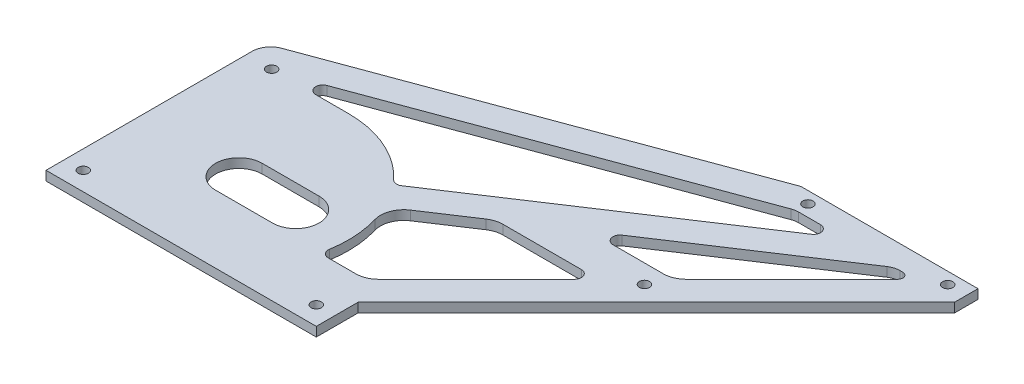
ISO-10303-21;
HEADER;
FILE_DESCRIPTION(('STEP AP214'),'2;1');
FILE_NAME('part.step','',(''),(''),'','','');
FILE_SCHEMA(('AUTOMOTIVE_DESIGN { 1 0 10303 214 1 1 1 1 }'));
ENDSEC;
DATA;
#1=APPLICATION_CONTEXT('core data for automotive mechanical design processes');
#2=APPLICATION_PROTOCOL_DEFINITION('international standard','automotive_design',2000,#1);
#3=PRODUCT_CONTEXT('',#1,'mechanical');
#4=PRODUCT('Part','Part','',(#3));
#5=PRODUCT_RELATED_PRODUCT_CATEGORY('part','',(#4));
#6=PRODUCT_DEFINITION_FORMATION('','',#4);
#7=PRODUCT_DEFINITION_CONTEXT('part definition',#1,'design');
#8=PRODUCT_DEFINITION('design','',#6,#7);
#9=PRODUCT_DEFINITION_SHAPE('','',#8);
#10=(LENGTH_UNIT() NAMED_UNIT(*) SI_UNIT(.MILLI.,.METRE.));
#11=(NAMED_UNIT(*) PLANE_ANGLE_UNIT() SI_UNIT($,.RADIAN.));
#12=(NAMED_UNIT(*) SI_UNIT($,.STERADIAN.) SOLID_ANGLE_UNIT());
#13=UNCERTAINTY_MEASURE_WITH_UNIT(LENGTH_MEASURE(1.E-05),#10,'distance_accuracy_value','');
#14=(GEOMETRIC_REPRESENTATION_CONTEXT(3) GLOBAL_UNCERTAINTY_ASSIGNED_CONTEXT((#13)) GLOBAL_UNIT_ASSIGNED_CONTEXT((#10,
#11,#12)) REPRESENTATION_CONTEXT('',''));
#15=CARTESIAN_POINT('',(0.,0.,0.));
#16=DIRECTION('',(0.,0.,1.));
#17=DIRECTION('',(1.,0.,0.));
#18=AXIS2_PLACEMENT_3D('',#15,#16,#17);
#19=CARTESIAN_POINT('',(0.,2.,-40.212490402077));
#20=DIRECTION('',(0.,-1.,0.));
#21=DIRECTION('',(0.,0.,-1.));
#22=AXIS2_PLACEMENT_3D('',#19,#20,#21);
#23=PLANE('',#22);
#24=CARTESIAN_POINT('',(1.41927742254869,2.,-39.));
#25=DIRECTION('',(0.,1.,0.));
#26=DIRECTION('',(0.,0.,-1.));
#27=AXIS2_PLACEMENT_3D('',#24,#25,#26);
#28=CIRCLE('',#27,1.1);
#29=CARTESIAN_POINT('',(1.41927742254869,2.,-40.1));
#30=VERTEX_POINT('',#29);
#31=EDGE_CURVE('E319',#30,#30,#28,.T.);
#32=ORIENTED_EDGE('',*,*,#31,.F.);
#33=EDGE_LOOP('',(#32));
#34=FACE_BOUND('',#33,.T.);
#35=CARTESIAN_POINT('',(84.0000000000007,2.,-71.5));
#36=DIRECTION('',(0.,1.,0.));
#37=DIRECTION('',(0.,0.,1.));
#38=AXIS2_PLACEMENT_3D('',#35,#36,#37);
#39=CIRCLE('',#38,1.10000000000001);
#40=CARTESIAN_POINT('',(84.0000000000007,2.,-70.4));
#41=VERTEX_POINT('',#40);
#42=EDGE_CURVE('E325',#41,#41,#39,.T.);
#43=ORIENTED_EDGE('',*,*,#42,.F.);
#44=EDGE_LOOP('',(#43));
#45=FACE_BOUND('',#44,.T.);
#46=CARTESIAN_POINT('',(71.8933982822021,2.,-33.5));
#47=DIRECTION('',(0.,1.,0.));
#48=DIRECTION('',(0.,0.,-1.));
#49=AXIS2_PLACEMENT_3D('',#46,#47,#48);
#50=CIRCLE('',#49,1.50000000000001);
#51=CARTESIAN_POINT('',(72.9540584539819,2.,-32.4393398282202));
#52=VERTEX_POINT('',#51);
#53=CARTESIAN_POINT('',(71.8933982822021,2.,-35.));
#54=VERTEX_POINT('',#53);
#55=EDGE_CURVE('E331',#52,#54,#50,.T.);
#56=ORIENTED_EDGE('',*,*,#55,.F.);
#57=DIRECTION('',(0.707106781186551,0.,-0.707106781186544));
#58=VECTOR('',#57,1.);
#59=CARTESIAN_POINT('',(51.9791847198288,2.,-11.4644660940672));
#60=LINE('',#59,#58);
#61=CARTESIAN_POINT('',(51.9791847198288,2.,-11.4644660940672));
#62=VERTEX_POINT('',#61);
#63=EDGE_CURVE('E351',#62,#52,#60,.T.);
#64=ORIENTED_EDGE('',*,*,#63,.F.);
#65=CARTESIAN_POINT('',(48.443650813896,2.,-15.));
#66=DIRECTION('',(0.,1.,0.));
#67=DIRECTION('',(0.,0.,-1.));
#68=AXIS2_PLACEMENT_3D('',#65,#66,#67);
#69=CIRCLE('',#68,5.00000000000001);
#70=CARTESIAN_POINT('',(48.443650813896,2.,-9.99999999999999));
#71=VERTEX_POINT('',#70);
#72=EDGE_CURVE('E348',#71,#62,#69,.T.);
#73=ORIENTED_EDGE('',*,*,#72,.F.);
#74=DIRECTION('',(1.,0.,0.));
#75=VECTOR('',#74,1.);
#76=CARTESIAN_POINT('',(42.5779253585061,2.,-9.99999999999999));
#77=LINE('',#76,#75);
#78=CARTESIAN_POINT('',(42.5779253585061,2.,-9.99999999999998));
#79=VERTEX_POINT('',#78);
#80=EDGE_CURVE('E346',#79,#71,#77,.T.);
#81=ORIENTED_EDGE('',*,*,#80,.F.);
#82=CARTESIAN_POINT('',(42.5779253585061,2.,-11.5));
#83=DIRECTION('',(0.,1.,0.));
#84=DIRECTION('',(0.,0.,1.));
#85=AXIS2_PLACEMENT_3D('',#82,#83,#84);
#86=CIRCLE('',#85,1.49999999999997);
#87=CARTESIAN_POINT('',(41.0972498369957,2.,-11.7399999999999));
#88=VERTEX_POINT('',#87);
#89=EDGE_CURVE('E344',#88,#79,#86,.T.);
#90=ORIENTED_EDGE('',*,*,#89,.F.);
#91=CARTESIAN_POINT('',(17.9,2.,-15.5));
#92=DIRECTION('',(0.,-1.,0.));
#93=DIRECTION('',(0.,0.,1.));
#94=AXIS2_PLACEMENT_3D('',#91,#92,#93);
#95=CIRCLE('',#94,23.5);
#96=CARTESIAN_POINT('',(40.4470004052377,2.,-22.1244073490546));
#97=VERTEX_POINT('',#96);
#98=EDGE_CURVE('E342',#97,#88,#95,.T.);
#99=ORIENTED_EDGE('',*,*,#98,.F.);
#100=CARTESIAN_POINT('',(45.2442345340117,2.,-23.5338557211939));
#101=DIRECTION('',(0.,1.,0.));
#102=DIRECTION('',(0.,0.,1.));
#103=AXIS2_PLACEMENT_3D('',#100,#101,#102);
#104=CIRCLE('',#103,4.99999999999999);
#105=CARTESIAN_POINT('',(42.4911506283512,2.,-27.7076464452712));
#106=VERTEX_POINT('',#105);
#107=EDGE_CURVE('E340',#106,#97,#104,.T.);
#108=ORIENTED_EDGE('',*,*,#107,.F.);
#109=DIRECTION('',(-0.834758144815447,0.,0.550616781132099));
#110=VECTOR('',#109,1.);
#111=CARTESIAN_POINT('',(52.2940966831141,2.,-34.1737907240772));
#112=LINE('',#111,#110);
#113=CARTESIAN_POINT('',(52.2940966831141,2.,-34.1737907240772));
#114=VERTEX_POINT('',#113);
#115=EDGE_CURVE('E338',#114,#106,#112,.T.);
#116=ORIENTED_EDGE('',*,*,#115,.F.);
#117=CARTESIAN_POINT('',(55.0471805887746,2.,-30.));
#118=DIRECTION('',(0.,1.,0.));
#119=DIRECTION('',(0.,0.,-1.));
#120=AXIS2_PLACEMENT_3D('',#117,#118,#119);
#121=CIRCLE('',#120,5.);
#122=CARTESIAN_POINT('',(55.0471805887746,2.,-35.));
#123=VERTEX_POINT('',#122);
#124=EDGE_CURVE('E336',#123,#114,#121,.T.);
#125=ORIENTED_EDGE('',*,*,#124,.F.);
#126=DIRECTION('',(-1.,0.,0.));
#127=VECTOR('',#126,1.);
#128=CARTESIAN_POINT('',(55.0471805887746,2.,-35.));
#129=LINE('',#128,#127);
#130=EDGE_CURVE('E333',#54,#123,#129,.T.);
#131=ORIENTED_EDGE('',*,*,#130,.F.);
#132=EDGE_LOOP('',(#56,#64,#73,#81,#90,#99,#108,#116,#125,#131));
#133=FACE_BOUND('',#132,.T.);
#134=CARTESIAN_POINT('',(106.859083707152,2.,-67.9));
#135=DIRECTION('',(0.,1.,0.));
#136=DIRECTION('',(0.,0.,-1.));
#137=AXIS2_PLACEMENT_3D('',#134,#135,#136);
#138=CIRCLE('',#137,1.10000000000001);
#139=CARTESIAN_POINT('',(107.636901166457,2.,-67.1221825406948));
#140=VERTEX_POINT('',#139);
#141=CARTESIAN_POINT('',(106.859083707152,2.,-69.));
#142=VERTEX_POINT('',#141);
#143=EDGE_CURVE('E476',#140,#142,#138,.T.);
#144=ORIENTED_EDGE('',*,*,#143,.F.);
#145=DIRECTION('',(0.707106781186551,0.,-0.707106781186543));
#146=VECTOR('',#145,1.);
#147=CARTESIAN_POINT('',(84.9791847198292,2.,-44.4644660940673));
#148=LINE('',#147,#146);
#149=CARTESIAN_POINT('',(84.9791847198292,2.,-44.4644660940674));
#150=VERTEX_POINT('',#149);
#151=EDGE_CURVE('E492',#150,#140,#148,.T.);
#152=ORIENTED_EDGE('',*,*,#151,.F.);
#153=CARTESIAN_POINT('',(81.4436508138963,2.,-48.));
#154=DIRECTION('',(0.,1.,0.));
#155=DIRECTION('',(0.,0.,-1.));
#156=AXIS2_PLACEMENT_3D('',#153,#154,#155);
#157=CIRCLE('',#156,4.99999999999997);
#158=CARTESIAN_POINT('',(81.4436508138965,2.,-43.0000000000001));
#159=VERTEX_POINT('',#158);
#160=EDGE_CURVE('E489',#159,#150,#157,.T.);
#161=ORIENTED_EDGE('',*,*,#160,.F.);
#162=DIRECTION('',(1.,0.,0.));
#163=VECTOR('',#162,1.);
#164=CARTESIAN_POINT('',(70.673280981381,2.,-43.));
#165=LINE('',#164,#163);
#166=CARTESIAN_POINT('',(70.673280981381,2.,-43.));
#167=VERTEX_POINT('',#166);
#168=EDGE_CURVE('E487',#167,#159,#165,.T.);
#169=ORIENTED_EDGE('',*,*,#168,.F.);
#170=CARTESIAN_POINT('',(70.673280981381,2.,-44.5));
#171=DIRECTION('',(0.,1.,0.));
#172=DIRECTION('',(0.,0.,1.));
#173=AXIS2_PLACEMENT_3D('',#170,#171,#172);
#174=CIRCLE('',#173,1.49999999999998);
#175=CARTESIAN_POINT('',(69.8473558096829,2.,-45.7521372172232));
#176=VERTEX_POINT('',#175);
#177=EDGE_CURVE('E485',#176,#167,#174,.T.);
#178=ORIENTED_EDGE('',*,*,#177,.F.);
#179=DIRECTION('',(-0.834758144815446,0.,0.550616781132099));
#180=VECTOR('',#179,1.);
#181=CARTESIAN_POINT('',(104.090036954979,2.,-68.3390325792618));
#182=LINE('',#181,#180);
#183=CARTESIAN_POINT('',(104.090036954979,2.,-68.3390325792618));
#184=VERTEX_POINT('',#183);
#185=EDGE_CURVE('E483',#184,#176,#182,.T.);
#186=ORIENTED_EDGE('',*,*,#185,.F.);
#187=CARTESIAN_POINT('',(106.292504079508,2.,-65.));
#188=DIRECTION('',(0.,1.,0.));
#189=DIRECTION('',(0.,0.,-1.));
#190=AXIS2_PLACEMENT_3D('',#187,#188,#189);
#191=CIRCLE('',#190,4.00000000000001);
#192=CARTESIAN_POINT('',(106.292504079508,2.,-69.));
#193=VERTEX_POINT('',#192);
#194=EDGE_CURVE('E481',#193,#184,#191,.T.);
#195=ORIENTED_EDGE('',*,*,#194,.F.);
#196=DIRECTION('',(-1.,0.,0.));
#197=VECTOR('',#196,1.);
#198=CARTESIAN_POINT('',(106.292504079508,2.,-69.));
#199=LINE('',#198,#197);
#200=EDGE_CURVE('E478',#142,#193,#199,.T.);
#201=ORIENTED_EDGE('',*,*,#200,.F.);
#202=EDGE_LOOP('',(#144,#152,#161,#169,#178,#186,#195,#201));
#203=FACE_BOUND('',#202,.T.);
#204=DIRECTION('',(1.,0.,0.));
#205=VECTOR('',#204,1.);
#206=CARTESIAN_POINT('',(-4.,2.,4.));
#207=LINE('',#206,#205);
#208=CARTESIAN_POINT('',(-4.,2.,4.));
#209=VERTEX_POINT('',#208);
#210=CARTESIAN_POINT('',(54.,2.,4.));
#211=VERTEX_POINT('',#210);
#212=EDGE_CURVE('E553',#209,#211,#207,.T.);
#213=ORIENTED_EDGE('',*,*,#212,.T.);
#214=DIRECTION('',(0.,0.,-1.));
#215=VECTOR('',#214,1.);
#216=CARTESIAN_POINT('',(54.,2.,-4.99999999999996));
#217=LINE('',#216,#215);
#218=CARTESIAN_POINT('',(54.,2.,-4.99999999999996));
#219=VERTEX_POINT('',#218);
#220=EDGE_CURVE('E556',#211,#219,#217,.T.);
#221=ORIENTED_EDGE('',*,*,#220,.T.);
#222=DIRECTION('',(0.707106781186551,0.,-0.707106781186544));
#223=VECTOR('',#222,1.);
#224=CARTESIAN_POINT('',(54.,2.,-4.99999999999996));
#225=LINE('',#224,#223);
#226=CARTESIAN_POINT('',(118.000000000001,2.,-69.));
#227=VERTEX_POINT('',#226);
#228=EDGE_CURVE('E559',#219,#227,#225,.T.);
#229=ORIENTED_EDGE('',*,*,#228,.T.);
#230=DIRECTION('',(0.,0.,-1.));
#231=VECTOR('',#230,1.);
#232=CARTESIAN_POINT('',(118.000000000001,2.,-69.));
#233=LINE('',#232,#231);
#234=CARTESIAN_POINT('',(118.000000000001,2.,-74.));
#235=VERTEX_POINT('',#234);
#236=EDGE_CURVE('E561',#227,#235,#233,.T.);
#237=ORIENTED_EDGE('',*,*,#236,.T.);
#238=DIRECTION('',(-1.,0.,0.));
#239=VECTOR('',#238,1.);
#240=CARTESIAN_POINT('',(80.0000000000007,2.,-74.));
#241=LINE('',#240,#239);
#242=CARTESIAN_POINT('',(80.0000000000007,2.,-74.));
#243=VERTEX_POINT('',#242);
#244=EDGE_CURVE('E563',#235,#243,#241,.T.);
#245=ORIENTED_EDGE('',*,*,#244,.T.);
#246=DIRECTION('',(-0.938152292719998,0.,0.346222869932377));
#247=VECTOR('',#246,1.);
#248=CARTESIAN_POINT('',(-1.38489147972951,2.,-43.9650995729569));
#249=LINE('',#248,#247);
#250=CARTESIAN_POINT('',(-1.38489147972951,2.,-43.965099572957));
#251=VERTEX_POINT('',#250);
#252=EDGE_CURVE('E565',#243,#251,#249,.T.);
#253=ORIENTED_EDGE('',*,*,#252,.T.);
#254=CARTESIAN_POINT('',(0.,2.,-40.212490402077));
#255=DIRECTION('',(0.,1.,0.));
#256=DIRECTION('',(0.,0.,-1.));
#257=AXIS2_PLACEMENT_3D('',#254,#255,#256);
#258=CIRCLE('',#257,3.99999999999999);
#259=CARTESIAN_POINT('',(-4.,2.,-40.212490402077));
#260=VERTEX_POINT('',#259);
#261=EDGE_CURVE('E567',#251,#260,#258,.T.);
#262=ORIENTED_EDGE('',*,*,#261,.T.);
#263=DIRECTION('',(0.,0.,1.));
#264=VECTOR('',#263,1.);
#265=CARTESIAN_POINT('',(-4.,2.,-40.212490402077));
#266=LINE('',#265,#264);
#267=EDGE_CURVE('E569',#260,#209,#266,.T.);
#268=ORIENTED_EDGE('',*,*,#267,.T.);
#269=EDGE_LOOP('',(#213,#221,#229,#237,#245,#253,#262,#268));
#270=FACE_BOUND('',#269,.T.);
#271=CARTESIAN_POINT('',(0.,2.,0.));
#272=DIRECTION('',(0.,1.,0.));
#273=DIRECTION('',(0.,0.,1.));
#274=AXIS2_PLACEMENT_3D('',#271,#272,#273);
#275=CIRCLE('',#274,1.1);
#276=CARTESIAN_POINT('',(0.,2.,1.1));
#277=VERTEX_POINT('',#276);
#278=EDGE_CURVE('E547',#277,#277,#275,.T.);
#279=ORIENTED_EDGE('',*,*,#278,.F.);
#280=EDGE_LOOP('',(#279));
#281=FACE_BOUND('',#280,.T.);
#282=CARTESIAN_POINT('',(50.,2.,0.));
#283=DIRECTION('',(0.,1.,0.));
#284=DIRECTION('',(0.,0.,-1.));
#285=AXIS2_PLACEMENT_3D('',#282,#283,#284);
#286=CIRCLE('',#285,1.1);
#287=CARTESIAN_POINT('',(50.,2.,-1.1));
#288=VERTEX_POINT('',#287);
#289=EDGE_CURVE('E541',#288,#288,#286,.T.);
#290=ORIENTED_EDGE('',*,*,#289,.F.);
#291=EDGE_LOOP('',(#290));
#292=FACE_BOUND('',#291,.T.);
#293=CARTESIAN_POINT('',(81.4192774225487,2.,-39.));
#294=DIRECTION('',(0.,1.,0.));
#295=DIRECTION('',(0.,0.,1.));
#296=AXIS2_PLACEMENT_3D('',#293,#294,#295);
#297=CIRCLE('',#296,1.10000000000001);
#298=CARTESIAN_POINT('',(81.4192774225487,2.,-37.9));
#299=VERTEX_POINT('',#298);
#300=EDGE_CURVE('E535',#299,#299,#297,.T.);
#301=ORIENTED_EDGE('',*,*,#300,.F.);
#302=EDGE_LOOP('',(#301));
#303=FACE_BOUND('',#302,.T.);
#304=CARTESIAN_POINT('',(17.9,2.,-15.5));
#305=DIRECTION('',(0.,-1.,0.));
#306=DIRECTION('',(0.,0.,1.));
#307=AXIS2_PLACEMENT_3D('',#304,#305,#306);
#308=CIRCLE('',#307,23.5);
#309=CARTESIAN_POINT('',(17.9,2.,-39.));
#310=VERTEX_POINT('',#309);
#311=CARTESIAN_POINT('',(35.0966059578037,2.,-31.5164522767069));
#312=VERTEX_POINT('',#311);
#313=EDGE_CURVE('E410',#310,#312,#308,.T.);
#314=ORIENTED_EDGE('',*,*,#313,.F.);
#315=DIRECTION('',(1.,0.,0.));
#316=VECTOR('',#315,1.);
#317=CARTESIAN_POINT('',(17.9,2.,-39.));
#318=LINE('',#317,#316);
#319=CARTESIAN_POINT('',(10.888153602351,2.,-39.));
#320=VERTEX_POINT('',#319);
#321=EDGE_CURVE('E428',#320,#310,#318,.T.);
#322=ORIENTED_EDGE('',*,*,#321,.F.);
#323=CARTESIAN_POINT('',(10.888153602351,2.,-40.5));
#324=DIRECTION('',(0.,1.,0.));
#325=DIRECTION('',(0.,0.,1.));
#326=AXIS2_PLACEMENT_3D('',#323,#324,#325);
#327=CIRCLE('',#326,1.5);
#328=CARTESIAN_POINT('',(10.3688192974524,2.,-41.90722843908));
#329=VERTEX_POINT('',#328);
#330=EDGE_CURVE('E425',#329,#320,#327,.T.);
#331=ORIENTED_EDGE('',*,*,#330,.F.);
#332=DIRECTION('',(-0.938152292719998,0.,0.346222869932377));
#333=VECTOR('',#332,1.);
#334=CARTESIAN_POINT('',(10.3688192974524,2.,-41.90722843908));
#335=LINE('',#334,#333);
#336=CARTESIAN_POINT('',(83.1111412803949,2.,-68.75260917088));
#337=VERTEX_POINT('',#336);
#338=EDGE_CURVE('E423',#337,#329,#335,.T.);
#339=ORIENTED_EDGE('',*,*,#338,.F.);
#340=CARTESIAN_POINT('',(84.4960327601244,2.,-65.));
#341=DIRECTION('',(0.,1.,0.));
#342=DIRECTION('',(0.,0.,-1.));
#343=AXIS2_PLACEMENT_3D('',#340,#341,#342);
#344=CIRCLE('',#343,4.00000000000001);
#345=CARTESIAN_POINT('',(84.4960327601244,2.,-69.));
#346=VERTEX_POINT('',#345);
#347=EDGE_CURVE('E421',#346,#337,#344,.T.);
#348=ORIENTED_EDGE('',*,*,#347,.F.);
#349=DIRECTION('',(-1.,0.,0.));
#350=VECTOR('',#349,1.);
#351=CARTESIAN_POINT('',(84.4960327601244,2.,-69.));
#352=LINE('',#351,#350);
#353=CARTESIAN_POINT('',(89.1969396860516,2.,-69.));
#354=VERTEX_POINT('',#353);
#355=EDGE_CURVE('E419',#354,#346,#352,.T.);
#356=ORIENTED_EDGE('',*,*,#355,.F.);
#357=CARTESIAN_POINT('',(89.1969396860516,2.,-67.5));
#358=DIRECTION('',(0.,1.,0.));
#359=DIRECTION('',(0.,0.,1.));
#360=AXIS2_PLACEMENT_3D('',#357,#358,#359);
#361=CIRCLE('',#360,1.50000000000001);
#362=CARTESIAN_POINT('',(90.0228648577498,2.,-66.2478627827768));
#363=VERTEX_POINT('',#362);
#364=EDGE_CURVE('E417',#363,#354,#361,.T.);
#365=ORIENTED_EDGE('',*,*,#364,.F.);
#366=DIRECTION('',(0.834758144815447,0.,-0.550616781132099));
#367=VECTOR('',#366,1.);
#368=CARTESIAN_POINT('',(90.0228648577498,2.,-66.2478627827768));
#369=LINE('',#368,#367);
#370=CARTESIAN_POINT('',(37.0201868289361,2.,-31.2866418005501));
#371=VERTEX_POINT('',#370);
#372=EDGE_CURVE('E415',#371,#363,#369,.T.);
#373=ORIENTED_EDGE('',*,*,#372,.F.);
#374=CARTESIAN_POINT('',(36.1942616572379,2.,-32.5387790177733));
#375=DIRECTION('',(0.,1.,0.));
#376=DIRECTION('',(0.,0.,1.));
#377=AXIS2_PLACEMENT_3D('',#374,#375,#376);
#378=CIRCLE('',#377,1.49999999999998);
#379=EDGE_CURVE('E412',#312,#371,#378,.T.);
#380=ORIENTED_EDGE('',*,*,#379,.F.);
#381=EDGE_LOOP('',(#314,#322,#331,#339,#348,#356,#365,#373,#380));
#382=FACE_BOUND('',#381,.T.);
#383=CARTESIAN_POINT('',(114.000000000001,2.,-71.5));
#384=DIRECTION('',(0.,1.,0.));
#385=DIRECTION('',(0.,0.,1.));
#386=AXIS2_PLACEMENT_3D('',#383,#384,#385);
#387=CIRCLE('',#386,1.10000000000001);
#388=CARTESIAN_POINT('',(114.000000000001,2.,-70.4));
#389=VERTEX_POINT('',#388);
#390=EDGE_CURVE('E404',#389,#389,#387,.T.);
#391=ORIENTED_EDGE('',*,*,#390,.F.);
#392=EDGE_LOOP('',(#391));
#393=FACE_BOUND('',#392,.T.);
#394=CARTESIAN_POINT('',(17.9,2.,-15.5));
#395=DIRECTION('',(0.,1.,0.));
#396=DIRECTION('',(0.,0.,1.));
#397=AXIS2_PLACEMENT_3D('',#394,#395,#396);
#398=CIRCLE('',#397,5.);
#399=CARTESIAN_POINT('',(17.9,2.,-20.5));
#400=VERTEX_POINT('',#399);
#401=CARTESIAN_POINT('',(17.9,2.,-10.5));
#402=VERTEX_POINT('',#401);
#403=EDGE_CURVE('E283',#400,#402,#398,.T.);
#404=ORIENTED_EDGE('',*,*,#403,.F.);
#405=DIRECTION('',(-1.,0.,0.));
#406=VECTOR('',#405,1.);
#407=CARTESIAN_POINT('',(17.9,2.,-20.5));
#408=LINE('',#407,#406);
#409=CARTESIAN_POINT('',(30.1,2.,-20.5));
#410=VERTEX_POINT('',#409);
#411=EDGE_CURVE('E305',#410,#400,#408,.T.);
#412=ORIENTED_EDGE('',*,*,#411,.F.);
#413=CARTESIAN_POINT('',(30.1,2.,-15.5));
#414=DIRECTION('',(0.,1.,0.));
#415=DIRECTION('',(0.,0.,1.));
#416=AXIS2_PLACEMENT_3D('',#413,#414,#415);
#417=CIRCLE('',#416,5.);
#418=CARTESIAN_POINT('',(30.1,2.,-10.5));
#419=VERTEX_POINT('',#418);
#420=EDGE_CURVE('E303',#419,#410,#417,.T.);
#421=ORIENTED_EDGE('',*,*,#420,.F.);
#422=DIRECTION('',(1.,0.,0.));
#423=VECTOR('',#422,1.);
#424=CARTESIAN_POINT('',(17.9,2.,-10.5));
#425=LINE('',#424,#423);
#426=EDGE_CURVE('E291',#402,#419,#425,.T.);
#427=ORIENTED_EDGE('',*,*,#426,.F.);
#428=EDGE_LOOP('',(#404,#412,#421,#427));
#429=FACE_BOUND('',#428,.T.);
#430=ADVANCED_FACE('F32',(#34,#45,#133,#203,#270,#281,#292,#303,#382,#393,#429),#23,.F.);
#431=CARTESIAN_POINT('',(0.,0.,-40.212490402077));
#432=DIRECTION('',(0.,-1.,0.));
#433=DIRECTION('',(0.,0.,-1.));
#434=AXIS2_PLACEMENT_3D('',#431,#432,#433);
#435=PLANE('',#434);
#436=CARTESIAN_POINT('',(84.0000000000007,0.,-71.5));
#437=DIRECTION('',(0.,1.,0.));
#438=DIRECTION('',(0.,0.,1.));
#439=AXIS2_PLACEMENT_3D('',#436,#437,#438);
#440=CIRCLE('',#439,1.10000000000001);
#441=CARTESIAN_POINT('',(84.0000000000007,0.,-70.4));
#442=VERTEX_POINT('',#441);
#443=EDGE_CURVE('E322',#442,#442,#440,.T.);
#444=ORIENTED_EDGE('',*,*,#443,.T.);
#445=EDGE_LOOP('',(#444));
#446=FACE_BOUND('',#445,.T.);
#447=DIRECTION('',(1.,0.,0.));
#448=VECTOR('',#447,1.);
#449=CARTESIAN_POINT('',(17.9,0.,-39.));
#450=LINE('',#449,#448);
#451=CARTESIAN_POINT('',(10.888153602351,0.,-39.));
#452=VERTEX_POINT('',#451);
#453=CARTESIAN_POINT('',(17.9,0.,-39.));
#454=VERTEX_POINT('',#453);
#455=EDGE_CURVE('E413',#452,#454,#450,.T.);
#456=ORIENTED_EDGE('',*,*,#455,.T.);
#457=CARTESIAN_POINT('',(17.9,0.,-15.5));
#458=DIRECTION('',(0.,-1.,0.));
#459=DIRECTION('',(0.,0.,1.));
#460=AXIS2_PLACEMENT_3D('',#457,#458,#459);
#461=CIRCLE('',#460,23.5);
#462=CARTESIAN_POINT('',(35.0966059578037,0.,-31.5164522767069));
#463=VERTEX_POINT('',#462);
#464=EDGE_CURVE('E407',#454,#463,#461,.T.);
#465=ORIENTED_EDGE('',*,*,#464,.T.);
#466=CARTESIAN_POINT('',(36.1942616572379,0.,-32.5387790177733));
#467=DIRECTION('',(0.,1.,0.));
#468=DIRECTION('',(0.,0.,1.));
#469=AXIS2_PLACEMENT_3D('',#466,#467,#468);
#470=CIRCLE('',#469,1.49999999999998);
#471=CARTESIAN_POINT('',(37.0201868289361,0.,-31.2866418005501));
#472=VERTEX_POINT('',#471);
#473=EDGE_CURVE('E433',#463,#472,#470,.T.);
#474=ORIENTED_EDGE('',*,*,#473,.T.);
#475=DIRECTION('',(0.834758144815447,0.,-0.550616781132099));
#476=VECTOR('',#475,1.);
#477=CARTESIAN_POINT('',(90.0228648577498,0.,-66.2478627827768));
#478=LINE('',#477,#476);
#479=CARTESIAN_POINT('',(90.0228648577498,0.,-66.2478627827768));
#480=VERTEX_POINT('',#479);
#481=EDGE_CURVE('E436',#472,#480,#478,.T.);
#482=ORIENTED_EDGE('',*,*,#481,.T.);
#483=CARTESIAN_POINT('',(89.1969396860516,0.,-67.5));
#484=DIRECTION('',(0.,1.,0.));
#485=DIRECTION('',(0.,0.,1.));
#486=AXIS2_PLACEMENT_3D('',#483,#484,#485);
#487=CIRCLE('',#486,1.50000000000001);
#488=CARTESIAN_POINT('',(89.1969396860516,0.,-69.));
#489=VERTEX_POINT('',#488);
#490=EDGE_CURVE('E439',#480,#489,#487,.T.);
#491=ORIENTED_EDGE('',*,*,#490,.T.);
#492=DIRECTION('',(-1.,0.,0.));
#493=VECTOR('',#492,1.);
#494=CARTESIAN_POINT('',(84.4960327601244,0.,-69.));
#495=LINE('',#494,#493);
#496=CARTESIAN_POINT('',(84.4960327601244,0.,-69.));
#497=VERTEX_POINT('',#496);
#498=EDGE_CURVE('E442',#489,#497,#495,.T.);
#499=ORIENTED_EDGE('',*,*,#498,.T.);
#500=CARTESIAN_POINT('',(84.4960327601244,0.,-65.));
#501=DIRECTION('',(0.,1.,0.));
#502=DIRECTION('',(0.,0.,-1.));
#503=AXIS2_PLACEMENT_3D('',#500,#501,#502);
#504=CIRCLE('',#503,4.00000000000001);
#505=CARTESIAN_POINT('',(83.1111412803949,0.,-68.75260917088));
#506=VERTEX_POINT('',#505);
#507=EDGE_CURVE('E445',#497,#506,#504,.T.);
#508=ORIENTED_EDGE('',*,*,#507,.T.);
#509=DIRECTION('',(-0.938152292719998,0.,0.346222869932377));
#510=VECTOR('',#509,1.);
#511=CARTESIAN_POINT('',(10.3688192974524,0.,-41.90722843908));
#512=LINE('',#511,#510);
#513=CARTESIAN_POINT('',(10.3688192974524,0.,-41.90722843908));
#514=VERTEX_POINT('',#513);
#515=EDGE_CURVE('E448',#506,#514,#512,.T.);
#516=ORIENTED_EDGE('',*,*,#515,.T.);
#517=CARTESIAN_POINT('',(10.888153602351,0.,-40.5));
#518=DIRECTION('',(0.,1.,0.));
#519=DIRECTION('',(0.,0.,1.));
#520=AXIS2_PLACEMENT_3D('',#517,#518,#519);
#521=CIRCLE('',#520,1.5);
#522=EDGE_CURVE('E451',#514,#452,#521,.T.);
#523=ORIENTED_EDGE('',*,*,#522,.T.);
#524=EDGE_LOOP('',(#456,#465,#474,#482,#491,#499,#508,#516,#523));
#525=FACE_BOUND('',#524,.T.);
#526=DIRECTION('',(0.707106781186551,0.,-0.707106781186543));
#527=VECTOR('',#526,1.);
#528=CARTESIAN_POINT('',(84.9791847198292,0.,-44.4644660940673));
#529=LINE('',#528,#527);
#530=CARTESIAN_POINT('',(84.9791847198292,0.,-44.4644660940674));
#531=VERTEX_POINT('',#530);
#532=CARTESIAN_POINT('',(107.636901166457,0.,-67.1221825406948));
#533=VERTEX_POINT('',#532);
#534=EDGE_CURVE('E479',#531,#533,#529,.T.);
#535=ORIENTED_EDGE('',*,*,#534,.T.);
#536=CARTESIAN_POINT('',(106.859083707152,0.,-67.9));
#537=DIRECTION('',(0.,1.,0.));
#538=DIRECTION('',(0.,0.,-1.));
#539=AXIS2_PLACEMENT_3D('',#536,#537,#538);
#540=CIRCLE('',#539,1.10000000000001);
#541=CARTESIAN_POINT('',(106.859083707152,0.,-69.));
#542=VERTEX_POINT('',#541);
#543=EDGE_CURVE('E475',#533,#542,#540,.T.);
#544=ORIENTED_EDGE('',*,*,#543,.T.);
#545=DIRECTION('',(-1.,0.,0.));
#546=VECTOR('',#545,1.);
#547=CARTESIAN_POINT('',(106.292504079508,0.,-69.));
#548=LINE('',#547,#546);
#549=CARTESIAN_POINT('',(106.292504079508,0.,-69.));
#550=VERTEX_POINT('',#549);
#551=EDGE_CURVE('E497',#542,#550,#548,.T.);
#552=ORIENTED_EDGE('',*,*,#551,.T.);
#553=CARTESIAN_POINT('',(106.292504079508,0.,-65.));
#554=DIRECTION('',(0.,1.,0.));
#555=DIRECTION('',(0.,0.,-1.));
#556=AXIS2_PLACEMENT_3D('',#553,#554,#555);
#557=CIRCLE('',#556,4.00000000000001);
#558=CARTESIAN_POINT('',(104.090036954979,0.,-68.3390325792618));
#559=VERTEX_POINT('',#558);
#560=EDGE_CURVE('E500',#550,#559,#557,.T.);
#561=ORIENTED_EDGE('',*,*,#560,.T.);
#562=DIRECTION('',(-0.834758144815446,0.,0.550616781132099));
#563=VECTOR('',#562,1.);
#564=CARTESIAN_POINT('',(104.090036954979,0.,-68.3390325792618));
#565=LINE('',#564,#563);
#566=CARTESIAN_POINT('',(69.8473558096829,0.,-45.7521372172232));
#567=VERTEX_POINT('',#566);
#568=EDGE_CURVE('E503',#559,#567,#565,.T.);
#569=ORIENTED_EDGE('',*,*,#568,.T.);
#570=CARTESIAN_POINT('',(70.673280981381,0.,-44.5));
#571=DIRECTION('',(0.,1.,0.));
#572=DIRECTION('',(0.,0.,1.));
#573=AXIS2_PLACEMENT_3D('',#570,#571,#572);
#574=CIRCLE('',#573,1.49999999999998);
#575=CARTESIAN_POINT('',(70.673280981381,0.,-43.));
#576=VERTEX_POINT('',#575);
#577=EDGE_CURVE('E506',#567,#576,#574,.T.);
#578=ORIENTED_EDGE('',*,*,#577,.T.);
#579=DIRECTION('',(1.,0.,0.));
#580=VECTOR('',#579,1.);
#581=CARTESIAN_POINT('',(70.673280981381,0.,-43.));
#582=LINE('',#581,#580);
#583=CARTESIAN_POINT('',(81.4436508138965,0.,-43.0000000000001));
#584=VERTEX_POINT('',#583);
#585=EDGE_CURVE('E509',#576,#584,#582,.T.);
#586=ORIENTED_EDGE('',*,*,#585,.T.);
#587=CARTESIAN_POINT('',(81.4436508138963,0.,-48.));
#588=DIRECTION('',(0.,1.,0.));
#589=DIRECTION('',(0.,0.,-1.));
#590=AXIS2_PLACEMENT_3D('',#587,#588,#589);
#591=CIRCLE('',#590,4.99999999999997);
#592=EDGE_CURVE('E512',#584,#531,#591,.T.);
#593=ORIENTED_EDGE('',*,*,#592,.T.);
#594=EDGE_LOOP('',(#535,#544,#552,#561,#569,#578,#586,#593));
#595=FACE_BOUND('',#594,.T.);
#596=CARTESIAN_POINT('',(81.4192774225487,0.,-39.));
#597=DIRECTION('',(0.,1.,0.));
#598=DIRECTION('',(0.,0.,1.));
#599=AXIS2_PLACEMENT_3D('',#596,#597,#598);
#600=CIRCLE('',#599,1.10000000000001);
#601=CARTESIAN_POINT('',(81.4192774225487,0.,-37.9));
#602=VERTEX_POINT('',#601);
#603=EDGE_CURVE('E534',#602,#602,#600,.T.);
#604=ORIENTED_EDGE('',*,*,#603,.T.);
#605=EDGE_LOOP('',(#604));
#606=FACE_BOUND('',#605,.T.);
#607=CARTESIAN_POINT('',(0.,0.,0.));
#608=DIRECTION('',(0.,1.,0.));
#609=DIRECTION('',(0.,0.,1.));
#610=AXIS2_PLACEMENT_3D('',#607,#608,#609);
#611=CIRCLE('',#610,1.1);
#612=CARTESIAN_POINT('',(0.,0.,1.1));
#613=VERTEX_POINT('',#612);
#614=EDGE_CURVE('E544',#613,#613,#611,.T.);
#615=ORIENTED_EDGE('',*,*,#614,.T.);
#616=EDGE_LOOP('',(#615));
#617=FACE_BOUND('',#616,.T.);
#618=DIRECTION('',(1.,0.,0.));
#619=VECTOR('',#618,1.);
#620=CARTESIAN_POINT('',(-4.,0.,4.));
#621=LINE('',#620,#619);
#622=CARTESIAN_POINT('',(-4.,0.,4.));
#623=VERTEX_POINT('',#622);
#624=CARTESIAN_POINT('',(54.,0.,4.));
#625=VERTEX_POINT('',#624);
#626=EDGE_CURVE('E550',#623,#625,#621,.T.);
#627=ORIENTED_EDGE('',*,*,#626,.F.);
#628=DIRECTION('',(0.,0.,1.));
#629=VECTOR('',#628,1.);
#630=CARTESIAN_POINT('',(-4.,0.,-40.212490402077));
#631=LINE('',#630,#629);
#632=CARTESIAN_POINT('',(-4.,0.,-40.212490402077));
#633=VERTEX_POINT('',#632);
#634=EDGE_CURVE('E557',#633,#623,#631,.T.);
#635=ORIENTED_EDGE('',*,*,#634,.F.);
#636=CARTESIAN_POINT('',(0.,0.,-40.212490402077));
#637=DIRECTION('',(0.,1.,0.));
#638=DIRECTION('',(0.,0.,-1.));
#639=AXIS2_PLACEMENT_3D('',#636,#637,#638);
#640=CIRCLE('',#639,3.99999999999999);
#641=CARTESIAN_POINT('',(-1.38489147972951,0.,-43.965099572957));
#642=VERTEX_POINT('',#641);
#643=EDGE_CURVE('E584',#642,#633,#640,.T.);
#644=ORIENTED_EDGE('',*,*,#643,.F.);
#645=DIRECTION('',(-0.938152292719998,0.,0.346222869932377));
#646=VECTOR('',#645,1.);
#647=CARTESIAN_POINT('',(-1.38489147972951,0.,-43.9650995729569));
#648=LINE('',#647,#646);
#649=CARTESIAN_POINT('',(80.0000000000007,0.,-74.));
#650=VERTEX_POINT('',#649);
#651=EDGE_CURVE('E582',#650,#642,#648,.T.);
#652=ORIENTED_EDGE('',*,*,#651,.F.);
#653=DIRECTION('',(-1.,0.,0.));
#654=VECTOR('',#653,1.);
#655=CARTESIAN_POINT('',(80.0000000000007,0.,-74.));
#656=LINE('',#655,#654);
#657=CARTESIAN_POINT('',(118.000000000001,0.,-74.));
#658=VERTEX_POINT('',#657);
#659=EDGE_CURVE('E580',#658,#650,#656,.T.);
#660=ORIENTED_EDGE('',*,*,#659,.F.);
#661=DIRECTION('',(0.,0.,-1.));
#662=VECTOR('',#661,1.);
#663=CARTESIAN_POINT('',(118.000000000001,0.,-69.));
#664=LINE('',#663,#662);
#665=CARTESIAN_POINT('',(118.000000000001,0.,-69.));
#666=VERTEX_POINT('',#665);
#667=EDGE_CURVE('E578',#666,#658,#664,.T.);
#668=ORIENTED_EDGE('',*,*,#667,.F.);
#669=DIRECTION('',(0.707106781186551,0.,-0.707106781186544));
#670=VECTOR('',#669,1.);
#671=CARTESIAN_POINT('',(54.,0.,-4.99999999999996));
#672=LINE('',#671,#670);
#673=CARTESIAN_POINT('',(54.,0.,-4.99999999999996));
#674=VERTEX_POINT('',#673);
#675=EDGE_CURVE('E576',#674,#666,#672,.T.);
#676=ORIENTED_EDGE('',*,*,#675,.F.);
#677=DIRECTION('',(0.,0.,-1.));
#678=VECTOR('',#677,1.);
#679=CARTESIAN_POINT('',(54.,0.,-4.99999999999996));
#680=LINE('',#679,#678);
#681=EDGE_CURVE('E574',#625,#674,#680,.T.);
#682=ORIENTED_EDGE('',*,*,#681,.F.);
#683=EDGE_LOOP('',(#627,#635,#644,#652,#660,#668,#676,#682));
#684=FACE_BOUND('',#683,.T.);
#685=CARTESIAN_POINT('',(50.,0.,0.));
#686=DIRECTION('',(0.,1.,0.));
#687=DIRECTION('',(0.,0.,-1.));
#688=AXIS2_PLACEMENT_3D('',#685,#686,#687);
#689=CIRCLE('',#688,1.1);
#690=CARTESIAN_POINT('',(50.,0.,-1.1));
#691=VERTEX_POINT('',#690);
#692=EDGE_CURVE('E538',#691,#691,#689,.T.);
#693=ORIENTED_EDGE('',*,*,#692,.T.);
#694=EDGE_LOOP('',(#693));
#695=FACE_BOUND('',#694,.T.);
#696=CARTESIAN_POINT('',(114.000000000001,0.,-71.5));
#697=DIRECTION('',(0.,1.,0.));
#698=DIRECTION('',(0.,0.,1.));
#699=AXIS2_PLACEMENT_3D('',#696,#697,#698);
#700=CIRCLE('',#699,1.10000000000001);
#701=CARTESIAN_POINT('',(114.000000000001,0.,-70.4));
#702=VERTEX_POINT('',#701);
#703=EDGE_CURVE('E403',#702,#702,#700,.T.);
#704=ORIENTED_EDGE('',*,*,#703,.T.);
#705=EDGE_LOOP('',(#704));
#706=FACE_BOUND('',#705,.T.);
#707=DIRECTION('',(0.707106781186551,0.,-0.707106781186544));
#708=VECTOR('',#707,1.);
#709=CARTESIAN_POINT('',(51.9791847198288,0.,-11.4644660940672));
#710=LINE('',#709,#708);
#711=CARTESIAN_POINT('',(51.9791847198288,0.,-11.4644660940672));
#712=VERTEX_POINT('',#711);
#713=CARTESIAN_POINT('',(72.9540584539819,0.,-32.4393398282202));
#714=VERTEX_POINT('',#713);
#715=EDGE_CURVE('E334',#712,#714,#710,.T.);
#716=ORIENTED_EDGE('',*,*,#715,.T.);
#717=CARTESIAN_POINT('',(71.8933982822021,0.,-33.5));
#718=DIRECTION('',(0.,1.,0.));
#719=DIRECTION('',(0.,0.,-1.));
#720=AXIS2_PLACEMENT_3D('',#717,#718,#719);
#721=CIRCLE('',#720,1.50000000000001);
#722=CARTESIAN_POINT('',(71.8933982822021,0.,-35.));
#723=VERTEX_POINT('',#722);
#724=EDGE_CURVE('E328',#714,#723,#721,.T.);
#725=ORIENTED_EDGE('',*,*,#724,.T.);
#726=DIRECTION('',(-1.,0.,0.));
#727=VECTOR('',#726,1.);
#728=CARTESIAN_POINT('',(55.0471805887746,0.,-35.));
#729=LINE('',#728,#727);
#730=CARTESIAN_POINT('',(55.0471805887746,0.,-35.));
#731=VERTEX_POINT('',#730);
#732=EDGE_CURVE('E356',#723,#731,#729,.T.);
#733=ORIENTED_EDGE('',*,*,#732,.T.);
#734=CARTESIAN_POINT('',(55.0471805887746,0.,-30.));
#735=DIRECTION('',(0.,1.,0.));
#736=DIRECTION('',(0.,0.,-1.));
#737=AXIS2_PLACEMENT_3D('',#734,#735,#736);
#738=CIRCLE('',#737,5.);
#739=CARTESIAN_POINT('',(52.2940966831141,0.,-34.1737907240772));
#740=VERTEX_POINT('',#739);
#741=EDGE_CURVE('E359',#731,#740,#738,.T.);
#742=ORIENTED_EDGE('',*,*,#741,.T.);
#743=DIRECTION('',(-0.834758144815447,0.,0.550616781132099));
#744=VECTOR('',#743,1.);
#745=CARTESIAN_POINT('',(52.2940966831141,0.,-34.1737907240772));
#746=LINE('',#745,#744);
#747=CARTESIAN_POINT('',(42.4911506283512,0.,-27.7076464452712));
#748=VERTEX_POINT('',#747);
#749=EDGE_CURVE('E362',#740,#748,#746,.T.);
#750=ORIENTED_EDGE('',*,*,#749,.T.);
#751=CARTESIAN_POINT('',(45.2442345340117,0.,-23.5338557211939));
#752=DIRECTION('',(0.,1.,0.));
#753=DIRECTION('',(0.,0.,1.));
#754=AXIS2_PLACEMENT_3D('',#751,#752,#753);
#755=CIRCLE('',#754,4.99999999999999);
#756=CARTESIAN_POINT('',(40.4470004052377,0.,-22.1244073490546));
#757=VERTEX_POINT('',#756);
#758=EDGE_CURVE('E365',#748,#757,#755,.T.);
#759=ORIENTED_EDGE('',*,*,#758,.T.);
#760=CARTESIAN_POINT('',(17.9,0.,-15.5));
#761=DIRECTION('',(0.,-1.,0.));
#762=DIRECTION('',(0.,0.,1.));
#763=AXIS2_PLACEMENT_3D('',#760,#761,#762);
#764=CIRCLE('',#763,23.5);
#765=CARTESIAN_POINT('',(41.0972498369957,0.,-11.7399999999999));
#766=VERTEX_POINT('',#765);
#767=EDGE_CURVE('E368',#757,#766,#764,.T.);
#768=ORIENTED_EDGE('',*,*,#767,.T.);
#769=CARTESIAN_POINT('',(42.5779253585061,0.,-11.5));
#770=DIRECTION('',(0.,1.,0.));
#771=DIRECTION('',(0.,0.,1.));
#772=AXIS2_PLACEMENT_3D('',#769,#770,#771);
#773=CIRCLE('',#772,1.49999999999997);
#774=CARTESIAN_POINT('',(42.5779253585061,0.,-9.99999999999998));
#775=VERTEX_POINT('',#774);
#776=EDGE_CURVE('E371',#766,#775,#773,.T.);
#777=ORIENTED_EDGE('',*,*,#776,.T.);
#778=DIRECTION('',(1.,0.,0.));
#779=VECTOR('',#778,1.);
#780=CARTESIAN_POINT('',(42.5779253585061,0.,-9.99999999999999));
#781=LINE('',#780,#779);
#782=CARTESIAN_POINT('',(48.443650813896,0.,-9.99999999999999));
#783=VERTEX_POINT('',#782);
#784=EDGE_CURVE('E374',#775,#783,#781,.T.);
#785=ORIENTED_EDGE('',*,*,#784,.T.);
#786=CARTESIAN_POINT('',(48.443650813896,0.,-15.));
#787=DIRECTION('',(0.,1.,0.));
#788=DIRECTION('',(0.,0.,-1.));
#789=AXIS2_PLACEMENT_3D('',#786,#787,#788);
#790=CIRCLE('',#789,5.00000000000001);
#791=EDGE_CURVE('E377',#783,#712,#790,.T.);
#792=ORIENTED_EDGE('',*,*,#791,.T.);
#793=EDGE_LOOP('',(#716,#725,#733,#742,#750,#759,#768,#777,#785,#792));
#794=FACE_BOUND('',#793,.T.);
#795=CARTESIAN_POINT('',(1.41927742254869,0.,-39.));
#796=DIRECTION('',(0.,1.,0.));
#797=DIRECTION('',(0.,0.,-1.));
#798=AXIS2_PLACEMENT_3D('',#795,#796,#797);
#799=CIRCLE('',#798,1.1);
#800=CARTESIAN_POINT('',(1.41927742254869,0.,-40.1));
#801=VERTEX_POINT('',#800);
#802=EDGE_CURVE('E299',#801,#801,#799,.T.);
#803=ORIENTED_EDGE('',*,*,#802,.T.);
#804=EDGE_LOOP('',(#803));
#805=FACE_BOUND('',#804,.T.);
#806=DIRECTION('',(-1.,0.,0.));
#807=VECTOR('',#806,1.);
#808=CARTESIAN_POINT('',(17.9,0.,-20.5));
#809=LINE('',#808,#807);
#810=CARTESIAN_POINT('',(30.1,0.,-20.5));
#811=VERTEX_POINT('',#810);
#812=CARTESIAN_POINT('',(17.9,0.,-20.5));
#813=VERTEX_POINT('',#812);
#814=EDGE_CURVE('E292',#811,#813,#809,.T.);
#815=ORIENTED_EDGE('',*,*,#814,.T.);
#816=CARTESIAN_POINT('',(17.9,0.,-15.5));
#817=DIRECTION('',(0.,1.,0.));
#818=DIRECTION('',(0.,0.,1.));
#819=AXIS2_PLACEMENT_3D('',#816,#817,#818);
#820=CIRCLE('',#819,5.);
#821=CARTESIAN_POINT('',(17.9,0.,-10.5));
#822=VERTEX_POINT('',#821);
#823=EDGE_CURVE('E55',#813,#822,#820,.T.);
#824=ORIENTED_EDGE('',*,*,#823,.T.);
#825=DIRECTION('',(1.,0.,0.));
#826=VECTOR('',#825,1.);
#827=CARTESIAN_POINT('',(17.9,0.,-10.5));
#828=LINE('',#827,#826);
#829=CARTESIAN_POINT('',(30.1,0.,-10.5));
#830=VERTEX_POINT('',#829);
#831=EDGE_CURVE('E298',#822,#830,#828,.T.);
#832=ORIENTED_EDGE('',*,*,#831,.T.);
#833=CARTESIAN_POINT('',(30.1,0.,-15.5));
#834=DIRECTION('',(0.,1.,0.));
#835=DIRECTION('',(0.,0.,1.));
#836=AXIS2_PLACEMENT_3D('',#833,#834,#835);
#837=CIRCLE('',#836,5.);
#838=EDGE_CURVE('E311',#830,#811,#837,.T.);
#839=ORIENTED_EDGE('',*,*,#838,.T.);
#840=EDGE_LOOP('',(#815,#824,#832,#839));
#841=FACE_BOUND('',#840,.T.);
#842=ADVANCED_FACE('F614',(#446,#525,#595,#606,#617,#684,#695,#706,#794,#805,#841),#435,.T.);
#843=CARTESIAN_POINT('',(-4.,2.,4.));
#844=DIRECTION('',(0.,0.,-1.));
#845=DIRECTION('',(-1.,0.,0.));
#846=AXIS2_PLACEMENT_3D('',#843,#844,#845);
#847=PLANE('',#846);
#848=ORIENTED_EDGE('',*,*,#626,.T.);
#849=DIRECTION('',(0.,-1.,0.));
#850=VECTOR('',#849,1.);
#851=CARTESIAN_POINT('',(54.,2.,4.));
#852=LINE('',#851,#850);
#853=EDGE_CURVE('E11',#211,#625,#852,.T.);
#854=ORIENTED_EDGE('',*,*,#853,.F.);
#855=ORIENTED_EDGE('',*,*,#212,.F.);
#856=DIRECTION('',(0.,-1.,0.));
#857=VECTOR('',#856,1.);
#858=CARTESIAN_POINT('',(-4.,2.,4.));
#859=LINE('',#858,#857);
#860=EDGE_CURVE('E571',#209,#623,#859,.T.);
#861=ORIENTED_EDGE('',*,*,#860,.T.);
#862=EDGE_LOOP('',(#848,#854,#855,#861));
#863=FACE_BOUND('',#862,.T.);
#864=ADVANCED_FACE('F34',(#863),#847,.F.);
#865=CARTESIAN_POINT('',(54.,2.,-4.99999999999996));
#866=DIRECTION('',(-1.,0.,0.));
#867=DIRECTION('',(0.,0.,1.));
#868=AXIS2_PLACEMENT_3D('',#865,#866,#867);
#869=PLANE('',#868);
#870=ORIENTED_EDGE('',*,*,#681,.T.);
#871=DIRECTION('',(0.,-1.,0.));
#872=VECTOR('',#871,1.);
#873=CARTESIAN_POINT('',(54.,2.,-4.99999999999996));
#874=LINE('',#873,#872);
#875=EDGE_CURVE('E40',#219,#674,#874,.T.);
#876=ORIENTED_EDGE('',*,*,#875,.F.);
#877=ORIENTED_EDGE('',*,*,#220,.F.);
#878=ORIENTED_EDGE('',*,*,#853,.T.);
#879=EDGE_LOOP('',(#870,#876,#877,#878));
#880=FACE_BOUND('',#879,.T.);
#881=ADVANCED_FACE('F632',(#880),#869,.F.);
#882=CARTESIAN_POINT('',(54.,2.,-4.99999999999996));
#883=DIRECTION('',(-0.707106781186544,0.,-0.707106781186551));
#884=DIRECTION('',(-0.707106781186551,0.,0.707106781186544));
#885=AXIS2_PLACEMENT_3D('',#882,#883,#884);
#886=PLANE('',#885);
#887=ORIENTED_EDGE('',*,*,#675,.T.);
#888=DIRECTION('',(0.,-1.,0.));
#889=VECTOR('',#888,1.);
#890=CARTESIAN_POINT('',(118.000000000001,2.,-69.));
#891=LINE('',#890,#889);
#892=EDGE_CURVE('E601',#227,#666,#891,.T.);
#893=ORIENTED_EDGE('',*,*,#892,.F.);
#894=ORIENTED_EDGE('',*,*,#228,.F.);
#895=ORIENTED_EDGE('',*,*,#875,.T.);
#896=EDGE_LOOP('',(#887,#893,#894,#895));
#897=FACE_BOUND('',#896,.T.);
#898=ADVANCED_FACE('F608',(#897),#886,.F.);
#899=CARTESIAN_POINT('',(118.000000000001,2.,-69.));
#900=DIRECTION('',(-1.,0.,0.));
#901=DIRECTION('',(0.,0.,1.));
#902=AXIS2_PLACEMENT_3D('',#899,#900,#901);
#903=PLANE('',#902);
#904=ORIENTED_EDGE('',*,*,#667,.T.);
#905=DIRECTION('',(0.,-1.,0.));
#906=VECTOR('',#905,1.);
#907=CARTESIAN_POINT('',(118.000000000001,2.,-74.));
#908=LINE('',#907,#906);
#909=EDGE_CURVE('E598',#235,#658,#908,.T.);
#910=ORIENTED_EDGE('',*,*,#909,.F.);
#911=ORIENTED_EDGE('',*,*,#236,.F.);
#912=ORIENTED_EDGE('',*,*,#892,.T.);
#913=EDGE_LOOP('',(#904,#910,#911,#912));
#914=FACE_BOUND('',#913,.T.);
#915=ADVANCED_FACE('F620',(#914),#903,.F.);
#916=CARTESIAN_POINT('',(80.0000000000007,2.,-74.));
#917=DIRECTION('',(0.,0.,1.));
#918=DIRECTION('',(1.,0.,0.));
#919=AXIS2_PLACEMENT_3D('',#916,#917,#918);
#920=PLANE('',#919);
#921=ORIENTED_EDGE('',*,*,#659,.T.);
#922=DIRECTION('',(0.,-1.,0.));
#923=VECTOR('',#922,1.);
#924=CARTESIAN_POINT('',(80.0000000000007,2.,-74.));
#925=LINE('',#924,#923);
#926=EDGE_CURVE('E595',#243,#650,#925,.T.);
#927=ORIENTED_EDGE('',*,*,#926,.F.);
#928=ORIENTED_EDGE('',*,*,#244,.F.);
#929=ORIENTED_EDGE('',*,*,#909,.T.);
#930=EDGE_LOOP('',(#921,#927,#928,#929));
#931=FACE_BOUND('',#930,.T.);
#932=ADVANCED_FACE('F624',(#931),#920,.F.);
#933=CARTESIAN_POINT('',(-1.38489147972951,2.,-43.9650995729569));
#934=DIRECTION('',(0.346222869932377,0.,0.938152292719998));
#935=DIRECTION('',(0.938152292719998,0.,-0.346222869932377));
#936=AXIS2_PLACEMENT_3D('',#933,#934,#935);
#937=PLANE('',#936);
#938=ORIENTED_EDGE('',*,*,#651,.T.);
#939=DIRECTION('',(0.,-1.,0.));
#940=VECTOR('',#939,1.);
#941=CARTESIAN_POINT('',(-1.38489147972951,2.,-43.965099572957));
#942=LINE('',#941,#940);
#943=EDGE_CURVE('E592',#251,#642,#942,.T.);
#944=ORIENTED_EDGE('',*,*,#943,.F.);
#945=ORIENTED_EDGE('',*,*,#252,.F.);
#946=ORIENTED_EDGE('',*,*,#926,.T.);
#947=EDGE_LOOP('',(#938,#944,#945,#946));
#948=FACE_BOUND('',#947,.T.);
#949=ADVANCED_FACE('F645',(#948),#937,.F.);
#950=CARTESIAN_POINT('',(0.,2.,-40.212490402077));
#951=DIRECTION('',(0.,-1.,0.));
#952=DIRECTION('',(0.,0.,-1.));
#953=AXIS2_PLACEMENT_3D('',#950,#951,#952);
#954=CYLINDRICAL_SURFACE('',#953,3.99999999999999);
#955=ORIENTED_EDGE('',*,*,#643,.T.);
#956=DIRECTION('',(0.,-1.,0.));
#957=VECTOR('',#956,1.);
#958=CARTESIAN_POINT('',(-4.,2.,-40.212490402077));
#959=LINE('',#958,#957);
#960=EDGE_CURVE('E589',#260,#633,#959,.T.);
#961=ORIENTED_EDGE('',*,*,#960,.F.);
#962=ORIENTED_EDGE('',*,*,#261,.F.);
#963=ORIENTED_EDGE('',*,*,#943,.T.);
#964=EDGE_LOOP('',(#955,#961,#962,#963));
#965=FACE_BOUND('',#964,.T.);
#966=ADVANCED_FACE('F643',(#965),#954,.T.);
#967=CARTESIAN_POINT('',(-4.,2.,-40.212490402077));
#968=DIRECTION('',(1.,0.,0.));
#969=DIRECTION('',(0.,0.,-1.));
#970=AXIS2_PLACEMENT_3D('',#967,#968,#969);
#971=PLANE('',#970);
#972=ORIENTED_EDGE('',*,*,#634,.T.);
#973=ORIENTED_EDGE('',*,*,#860,.F.);
#974=ORIENTED_EDGE('',*,*,#267,.F.);
#975=ORIENTED_EDGE('',*,*,#960,.T.);
#976=EDGE_LOOP('',(#972,#973,#974,#975));
#977=FACE_BOUND('',#976,.T.);
#978=ADVANCED_FACE('F638',(#977),#971,.F.);
#979=CARTESIAN_POINT('',(0.,2.,0.));
#980=DIRECTION('',(0.,-1.,0.));
#981=DIRECTION('',(0.,0.,-1.));
#982=AXIS2_PLACEMENT_3D('',#979,#980,#981);
#983=CYLINDRICAL_SURFACE('',#982,1.1);
#984=ORIENTED_EDGE('',*,*,#278,.T.);
#985=EDGE_LOOP('',(#984));
#986=FACE_BOUND('',#985,.T.);
#987=ORIENTED_EDGE('',*,*,#614,.F.);
#988=EDGE_LOOP('',(#987));
#989=FACE_BOUND('',#988,.T.);
#990=ADVANCED_FACE('F665',(#986,#989),#983,.F.);
#991=CARTESIAN_POINT('',(50.,2.,0.));
#992=DIRECTION('',(0.,-1.,0.));
#993=DIRECTION('',(0.,0.,-1.));
#994=AXIS2_PLACEMENT_3D('',#991,#992,#993);
#995=CYLINDRICAL_SURFACE('',#994,1.1);
#996=ORIENTED_EDGE('',*,*,#289,.T.);
#997=EDGE_LOOP('',(#996));
#998=FACE_BOUND('',#997,.T.);
#999=ORIENTED_EDGE('',*,*,#692,.F.);
#1000=EDGE_LOOP('',(#999));
#1001=FACE_BOUND('',#1000,.T.);
#1002=ADVANCED_FACE('F672',(#998,#1001),#995,.F.);
#1003=CARTESIAN_POINT('',(81.4192774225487,2.,-39.));
#1004=DIRECTION('',(0.,-1.,0.));
#1005=DIRECTION('',(0.,0.,-1.));
#1006=AXIS2_PLACEMENT_3D('',#1003,#1004,#1005);
#1007=CYLINDRICAL_SURFACE('',#1006,1.10000000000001);
#1008=ORIENTED_EDGE('',*,*,#300,.T.);
#1009=EDGE_LOOP('',(#1008));
#1010=FACE_BOUND('',#1009,.T.);
#1011=ORIENTED_EDGE('',*,*,#603,.F.);
#1012=EDGE_LOOP('',(#1011));
#1013=FACE_BOUND('',#1012,.T.);
#1014=ADVANCED_FACE('F677',(#1010,#1013),#1007,.F.);
#1015=CARTESIAN_POINT('',(106.859083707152,2.,-67.9));
#1016=DIRECTION('',(0.,-1.,0.));
#1017=DIRECTION('',(0.,0.,-1.));
#1018=AXIS2_PLACEMENT_3D('',#1015,#1016,#1017);
#1019=CYLINDRICAL_SURFACE('',#1018,1.10000000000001);
#1020=ORIENTED_EDGE('',*,*,#543,.F.);
#1021=DIRECTION('',(0.,-1.,0.));
#1022=VECTOR('',#1021,1.);
#1023=CARTESIAN_POINT('',(107.636901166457,2.,-67.1221825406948));
#1024=LINE('',#1023,#1022);
#1025=EDGE_CURVE('E494',#140,#533,#1024,.T.);
#1026=ORIENTED_EDGE('',*,*,#1025,.F.);
#1027=ORIENTED_EDGE('',*,*,#143,.T.);
#1028=DIRECTION('',(0.,-1.,0.));
#1029=VECTOR('',#1028,1.);
#1030=CARTESIAN_POINT('',(106.859083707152,2.,-69.));
#1031=LINE('',#1030,#1029);
#1032=EDGE_CURVE('E531',#142,#542,#1031,.T.);
#1033=ORIENTED_EDGE('',*,*,#1032,.T.);
#1034=EDGE_LOOP('',(#1020,#1026,#1027,#1033));
#1035=FACE_BOUND('',#1034,.T.);
#1036=ADVANCED_FACE('F831',(#1035),#1019,.F.);
#1037=CARTESIAN_POINT('',(106.292504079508,2.,-69.));
#1038=DIRECTION('',(0.,0.,1.));
#1039=DIRECTION('',(1.,0.,0.));
#1040=AXIS2_PLACEMENT_3D('',#1037,#1038,#1039);
#1041=PLANE('',#1040);
#1042=ORIENTED_EDGE('',*,*,#551,.F.);
#1043=ORIENTED_EDGE('',*,*,#1032,.F.);
#1044=ORIENTED_EDGE('',*,*,#200,.T.);
#1045=DIRECTION('',(0.,-1.,0.));
#1046=VECTOR('',#1045,1.);
#1047=CARTESIAN_POINT('',(106.292504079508,2.,-69.));
#1048=LINE('',#1047,#1046);
#1049=EDGE_CURVE('E529',#193,#550,#1048,.T.);
#1050=ORIENTED_EDGE('',*,*,#1049,.T.);
#1051=EDGE_LOOP('',(#1042,#1043,#1044,#1050));
#1052=FACE_BOUND('',#1051,.T.);
#1053=ADVANCED_FACE('F827',(#1052),#1041,.T.);
#1054=CARTESIAN_POINT('',(106.292504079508,2.,-65.));
#1055=DIRECTION('',(0.,-1.,0.));
#1056=DIRECTION('',(0.,0.,-1.));
#1057=AXIS2_PLACEMENT_3D('',#1054,#1055,#1056);
#1058=CYLINDRICAL_SURFACE('',#1057,4.00000000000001);
#1059=ORIENTED_EDGE('',*,*,#560,.F.);
#1060=ORIENTED_EDGE('',*,*,#1049,.F.);
#1061=ORIENTED_EDGE('',*,*,#194,.T.);
#1062=DIRECTION('',(0.,-1.,0.));
#1063=VECTOR('',#1062,1.);
#1064=CARTESIAN_POINT('',(104.090036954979,2.,-68.3390325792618));
#1065=LINE('',#1064,#1063);
#1066=EDGE_CURVE('E527',#184,#559,#1065,.T.);
#1067=ORIENTED_EDGE('',*,*,#1066,.T.);
#1068=EDGE_LOOP('',(#1059,#1060,#1061,#1067));
#1069=FACE_BOUND('',#1068,.T.);
#1070=ADVANCED_FACE('F823',(#1069),#1058,.F.);
#1071=CARTESIAN_POINT('',(104.090036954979,2.,-68.3390325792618));
#1072=DIRECTION('',(0.550616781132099,0.,0.834758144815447));
#1073=DIRECTION('',(0.834758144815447,0.,-0.550616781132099));
#1074=AXIS2_PLACEMENT_3D('',#1071,#1072,#1073);
#1075=PLANE('',#1074);
#1076=ORIENTED_EDGE('',*,*,#568,.F.);
#1077=ORIENTED_EDGE('',*,*,#1066,.F.);
#1078=ORIENTED_EDGE('',*,*,#185,.T.);
#1079=DIRECTION('',(0.,-1.,0.));
#1080=VECTOR('',#1079,1.);
#1081=CARTESIAN_POINT('',(69.8473558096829,2.,-45.7521372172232));
#1082=LINE('',#1081,#1080);
#1083=EDGE_CURVE('E525',#176,#567,#1082,.T.);
#1084=ORIENTED_EDGE('',*,*,#1083,.T.);
#1085=EDGE_LOOP('',(#1076,#1077,#1078,#1084));
#1086=FACE_BOUND('',#1085,.T.);
#1087=ADVANCED_FACE('F819',(#1086),#1075,.T.);
#1088=CARTESIAN_POINT('',(70.673280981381,2.,-44.5));
#1089=DIRECTION('',(0.,-1.,0.));
#1090=DIRECTION('',(0.,0.,-1.));
#1091=AXIS2_PLACEMENT_3D('',#1088,#1089,#1090);
#1092=CYLINDRICAL_SURFACE('',#1091,1.49999999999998);
#1093=ORIENTED_EDGE('',*,*,#577,.F.);
#1094=ORIENTED_EDGE('',*,*,#1083,.F.);
#1095=ORIENTED_EDGE('',*,*,#177,.T.);
#1096=DIRECTION('',(0.,-1.,0.));
#1097=VECTOR('',#1096,1.);
#1098=CARTESIAN_POINT('',(70.673280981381,2.,-43.));
#1099=LINE('',#1098,#1097);
#1100=EDGE_CURVE('E523',#167,#576,#1099,.T.);
#1101=ORIENTED_EDGE('',*,*,#1100,.T.);
#1102=EDGE_LOOP('',(#1093,#1094,#1095,#1101));
#1103=FACE_BOUND('',#1102,.T.);
#1104=ADVANCED_FACE('F815',(#1103),#1092,.F.);
#1105=CARTESIAN_POINT('',(70.673280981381,2.,-43.));
#1106=DIRECTION('',(0.,0.,-1.));
#1107=DIRECTION('',(-1.,0.,0.));
#1108=AXIS2_PLACEMENT_3D('',#1105,#1106,#1107);
#1109=PLANE('',#1108);
#1110=ORIENTED_EDGE('',*,*,#585,.F.);
#1111=ORIENTED_EDGE('',*,*,#1100,.F.);
#1112=ORIENTED_EDGE('',*,*,#168,.T.);
#1113=DIRECTION('',(0.,-1.,0.));
#1114=VECTOR('',#1113,1.);
#1115=CARTESIAN_POINT('',(81.4436508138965,2.,-43.0000000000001));
#1116=LINE('',#1115,#1114);
#1117=EDGE_CURVE('E521',#159,#584,#1116,.T.);
#1118=ORIENTED_EDGE('',*,*,#1117,.T.);
#1119=EDGE_LOOP('',(#1110,#1111,#1112,#1118));
#1120=FACE_BOUND('',#1119,.T.);
#1121=ADVANCED_FACE('F811',(#1120),#1109,.T.);
#1122=CARTESIAN_POINT('',(81.4436508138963,2.,-48.));
#1123=DIRECTION('',(0.,-1.,0.));
#1124=DIRECTION('',(0.,0.,-1.));
#1125=AXIS2_PLACEMENT_3D('',#1122,#1123,#1124);
#1126=CYLINDRICAL_SURFACE('',#1125,4.99999999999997);
#1127=ORIENTED_EDGE('',*,*,#592,.F.);
#1128=ORIENTED_EDGE('',*,*,#1117,.F.);
#1129=ORIENTED_EDGE('',*,*,#160,.T.);
#1130=DIRECTION('',(0.,-1.,0.));
#1131=VECTOR('',#1130,1.);
#1132=CARTESIAN_POINT('',(84.9791847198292,2.,-44.4644660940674));
#1133=LINE('',#1132,#1131);
#1134=EDGE_CURVE('E519',#150,#531,#1133,.T.);
#1135=ORIENTED_EDGE('',*,*,#1134,.T.);
#1136=EDGE_LOOP('',(#1127,#1128,#1129,#1135));
#1137=FACE_BOUND('',#1136,.T.);
#1138=ADVANCED_FACE('F807',(#1137),#1126,.F.);
#1139=CARTESIAN_POINT('',(84.9791847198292,2.,-44.4644660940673));
#1140=DIRECTION('',(-0.707106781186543,0.,-0.707106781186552));
#1141=DIRECTION('',(-0.707106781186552,0.,0.707106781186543));
#1142=AXIS2_PLACEMENT_3D('',#1139,#1140,#1141);
#1143=PLANE('',#1142);
#1144=ORIENTED_EDGE('',*,*,#534,.F.);
#1145=ORIENTED_EDGE('',*,*,#1134,.F.);
#1146=ORIENTED_EDGE('',*,*,#151,.T.);
#1147=ORIENTED_EDGE('',*,*,#1025,.T.);
#1148=EDGE_LOOP('',(#1144,#1145,#1146,#1147));
#1149=FACE_BOUND('',#1148,.T.);
#1150=ADVANCED_FACE('F803',(#1149),#1143,.T.);
#1151=CARTESIAN_POINT('',(17.9,2.,-15.5));
#1152=DIRECTION('',(0.,-1.,0.));
#1153=DIRECTION('',(0.,0.,-1.));
#1154=AXIS2_PLACEMENT_3D('',#1151,#1152,#1153);
#1155=CYLINDRICAL_SURFACE('',#1154,23.5);
#1156=ORIENTED_EDGE('',*,*,#464,.F.);
#1157=DIRECTION('',(0.,-1.,0.));
#1158=VECTOR('',#1157,1.);
#1159=CARTESIAN_POINT('',(17.9,2.,-39.));
#1160=LINE('',#1159,#1158);
#1161=EDGE_CURVE('E430',#310,#454,#1160,.T.);
#1162=ORIENTED_EDGE('',*,*,#1161,.F.);
#1163=ORIENTED_EDGE('',*,*,#313,.T.);
#1164=DIRECTION('',(0.,-1.,0.));
#1165=VECTOR('',#1164,1.);
#1166=CARTESIAN_POINT('',(35.0966059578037,2.,-31.5164522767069));
#1167=LINE('',#1166,#1165);
#1168=EDGE_CURVE('E472',#312,#463,#1167,.T.);
#1169=ORIENTED_EDGE('',*,*,#1168,.T.);
#1170=EDGE_LOOP('',(#1156,#1162,#1163,#1169));
#1171=FACE_BOUND('',#1170,.T.);
#1172=ADVANCED_FACE('F799',(#1171),#1155,.T.);
#1173=CARTESIAN_POINT('',(36.1942616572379,2.,-32.5387790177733));
#1174=DIRECTION('',(0.,-1.,0.));
#1175=DIRECTION('',(0.,0.,-1.));
#1176=AXIS2_PLACEMENT_3D('',#1173,#1174,#1175);
#1177=CYLINDRICAL_SURFACE('',#1176,1.49999999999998);
#1178=ORIENTED_EDGE('',*,*,#473,.F.);
#1179=ORIENTED_EDGE('',*,*,#1168,.F.);
#1180=ORIENTED_EDGE('',*,*,#379,.T.);
#1181=DIRECTION('',(0.,-1.,0.));
#1182=VECTOR('',#1181,1.);
#1183=CARTESIAN_POINT('',(37.0201868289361,2.,-31.2866418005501));
#1184=LINE('',#1183,#1182);
#1185=EDGE_CURVE('E470',#371,#472,#1184,.T.);
#1186=ORIENTED_EDGE('',*,*,#1185,.T.);
#1187=EDGE_LOOP('',(#1178,#1179,#1180,#1186));
#1188=FACE_BOUND('',#1187,.T.);
#1189=ADVANCED_FACE('F795',(#1188),#1177,.F.);
#1190=CARTESIAN_POINT('',(90.0228648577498,2.,-66.2478627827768));
#1191=DIRECTION('',(-0.550616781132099,0.,-0.834758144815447));
#1192=DIRECTION('',(-0.834758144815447,0.,0.550616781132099));
#1193=AXIS2_PLACEMENT_3D('',#1190,#1191,#1192);
#1194=PLANE('',#1193);
#1195=ORIENTED_EDGE('',*,*,#481,.F.);
#1196=ORIENTED_EDGE('',*,*,#1185,.F.);
#1197=ORIENTED_EDGE('',*,*,#372,.T.);
#1198=DIRECTION('',(0.,-1.,0.));
#1199=VECTOR('',#1198,1.);
#1200=CARTESIAN_POINT('',(90.0228648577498,2.,-66.2478627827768));
#1201=LINE('',#1200,#1199);
#1202=EDGE_CURVE('E468',#363,#480,#1201,.T.);
#1203=ORIENTED_EDGE('',*,*,#1202,.T.);
#1204=EDGE_LOOP('',(#1195,#1196,#1197,#1203));
#1205=FACE_BOUND('',#1204,.T.);
#1206=ADVANCED_FACE('F791',(#1205),#1194,.T.);
#1207=CARTESIAN_POINT('',(89.1969396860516,2.,-67.5));
#1208=DIRECTION('',(0.,-1.,0.));
#1209=DIRECTION('',(0.,0.,-1.));
#1210=AXIS2_PLACEMENT_3D('',#1207,#1208,#1209);
#1211=CYLINDRICAL_SURFACE('',#1210,1.50000000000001);
#1212=ORIENTED_EDGE('',*,*,#490,.F.);
#1213=ORIENTED_EDGE('',*,*,#1202,.F.);
#1214=ORIENTED_EDGE('',*,*,#364,.T.);
#1215=DIRECTION('',(0.,-1.,0.));
#1216=VECTOR('',#1215,1.);
#1217=CARTESIAN_POINT('',(89.1969396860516,2.,-69.));
#1218=LINE('',#1217,#1216);
#1219=EDGE_CURVE('E466',#354,#489,#1218,.T.);
#1220=ORIENTED_EDGE('',*,*,#1219,.T.);
#1221=EDGE_LOOP('',(#1212,#1213,#1214,#1220));
#1222=FACE_BOUND('',#1221,.T.);
#1223=ADVANCED_FACE('F787',(#1222),#1211,.F.);
#1224=CARTESIAN_POINT('',(84.4960327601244,2.,-69.));
#1225=DIRECTION('',(0.,0.,1.));
#1226=DIRECTION('',(1.,0.,0.));
#1227=AXIS2_PLACEMENT_3D('',#1224,#1225,#1226);
#1228=PLANE('',#1227);
#1229=ORIENTED_EDGE('',*,*,#498,.F.);
#1230=ORIENTED_EDGE('',*,*,#1219,.F.);
#1231=ORIENTED_EDGE('',*,*,#355,.T.);
#1232=DIRECTION('',(0.,-1.,0.));
#1233=VECTOR('',#1232,1.);
#1234=CARTESIAN_POINT('',(84.4960327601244,2.,-69.));
#1235=LINE('',#1234,#1233);
#1236=EDGE_CURVE('E464',#346,#497,#1235,.T.);
#1237=ORIENTED_EDGE('',*,*,#1236,.T.);
#1238=EDGE_LOOP('',(#1229,#1230,#1231,#1237));
#1239=FACE_BOUND('',#1238,.T.);
#1240=ADVANCED_FACE('F783',(#1239),#1228,.T.);
#1241=CARTESIAN_POINT('',(84.4960327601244,2.,-65.));
#1242=DIRECTION('',(0.,-1.,0.));
#1243=DIRECTION('',(0.,0.,-1.));
#1244=AXIS2_PLACEMENT_3D('',#1241,#1242,#1243);
#1245=CYLINDRICAL_SURFACE('',#1244,4.00000000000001);
#1246=ORIENTED_EDGE('',*,*,#507,.F.);
#1247=ORIENTED_EDGE('',*,*,#1236,.F.);
#1248=ORIENTED_EDGE('',*,*,#347,.T.);
#1249=DIRECTION('',(0.,-1.,0.));
#1250=VECTOR('',#1249,1.);
#1251=CARTESIAN_POINT('',(83.1111412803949,2.,-68.75260917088));
#1252=LINE('',#1251,#1250);
#1253=EDGE_CURVE('E462',#337,#506,#1252,.T.);
#1254=ORIENTED_EDGE('',*,*,#1253,.T.);
#1255=EDGE_LOOP('',(#1246,#1247,#1248,#1254));
#1256=FACE_BOUND('',#1255,.T.);
#1257=ADVANCED_FACE('F779',(#1256),#1245,.F.);
#1258=CARTESIAN_POINT('',(10.3688192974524,2.,-41.90722843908));
#1259=DIRECTION('',(0.346222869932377,0.,0.938152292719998));
#1260=DIRECTION('',(0.938152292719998,0.,-0.346222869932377));
#1261=AXIS2_PLACEMENT_3D('',#1258,#1259,#1260);
#1262=PLANE('',#1261);
#1263=ORIENTED_EDGE('',*,*,#515,.F.);
#1264=ORIENTED_EDGE('',*,*,#1253,.F.);
#1265=ORIENTED_EDGE('',*,*,#338,.T.);
#1266=DIRECTION('',(0.,-1.,0.));
#1267=VECTOR('',#1266,1.);
#1268=CARTESIAN_POINT('',(10.3688192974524,2.,-41.90722843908));
#1269=LINE('',#1268,#1267);
#1270=EDGE_CURVE('E460',#329,#514,#1269,.T.);
#1271=ORIENTED_EDGE('',*,*,#1270,.T.);
#1272=EDGE_LOOP('',(#1263,#1264,#1265,#1271));
#1273=FACE_BOUND('',#1272,.T.);
#1274=ADVANCED_FACE('F775',(#1273),#1262,.T.);
#1275=CARTESIAN_POINT('',(10.888153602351,2.,-40.5));
#1276=DIRECTION('',(0.,-1.,0.));
#1277=DIRECTION('',(0.,0.,-1.));
#1278=AXIS2_PLACEMENT_3D('',#1275,#1276,#1277);
#1279=CYLINDRICAL_SURFACE('',#1278,1.5);
#1280=ORIENTED_EDGE('',*,*,#522,.F.);
#1281=ORIENTED_EDGE('',*,*,#1270,.F.);
#1282=ORIENTED_EDGE('',*,*,#330,.T.);
#1283=DIRECTION('',(0.,-1.,0.));
#1284=VECTOR('',#1283,1.);
#1285=CARTESIAN_POINT('',(10.888153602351,2.,-39.));
#1286=LINE('',#1285,#1284);
#1287=EDGE_CURVE('E458',#320,#452,#1286,.T.);
#1288=ORIENTED_EDGE('',*,*,#1287,.T.);
#1289=EDGE_LOOP('',(#1280,#1281,#1282,#1288));
#1290=FACE_BOUND('',#1289,.T.);
#1291=ADVANCED_FACE('F771',(#1290),#1279,.F.);
#1292=CARTESIAN_POINT('',(17.9,2.,-39.));
#1293=DIRECTION('',(0.,0.,-1.));
#1294=DIRECTION('',(-1.,0.,0.));
#1295=AXIS2_PLACEMENT_3D('',#1292,#1293,#1294);
#1296=PLANE('',#1295);
#1297=ORIENTED_EDGE('',*,*,#455,.F.);
#1298=ORIENTED_EDGE('',*,*,#1287,.F.);
#1299=ORIENTED_EDGE('',*,*,#321,.T.);
#1300=ORIENTED_EDGE('',*,*,#1161,.T.);
#1301=EDGE_LOOP('',(#1297,#1298,#1299,#1300));
#1302=FACE_BOUND('',#1301,.T.);
#1303=ADVANCED_FACE('F698',(#1302),#1296,.T.);
#1304=CARTESIAN_POINT('',(114.000000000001,2.,-71.5));
#1305=DIRECTION('',(0.,-1.,0.));
#1306=DIRECTION('',(0.,0.,-1.));
#1307=AXIS2_PLACEMENT_3D('',#1304,#1305,#1306);
#1308=CYLINDRICAL_SURFACE('',#1307,1.10000000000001);
#1309=ORIENTED_EDGE('',*,*,#390,.T.);
#1310=EDGE_LOOP('',(#1309));
#1311=FACE_BOUND('',#1310,.T.);
#1312=ORIENTED_EDGE('',*,*,#703,.F.);
#1313=EDGE_LOOP('',(#1312));
#1314=FACE_BOUND('',#1313,.T.);
#1315=ADVANCED_FACE('F694',(#1311,#1314),#1308,.F.);
#1316=CARTESIAN_POINT('',(71.8933982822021,2.,-33.5));
#1317=DIRECTION('',(0.,-1.,0.));
#1318=DIRECTION('',(0.,0.,-1.));
#1319=AXIS2_PLACEMENT_3D('',#1316,#1317,#1318);
#1320=CYLINDRICAL_SURFACE('',#1319,1.50000000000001);
#1321=ORIENTED_EDGE('',*,*,#724,.F.);
#1322=DIRECTION('',(0.,-1.,0.));
#1323=VECTOR('',#1322,1.);
#1324=CARTESIAN_POINT('',(72.9540584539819,2.,-32.4393398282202));
#1325=LINE('',#1324,#1323);
#1326=EDGE_CURVE('E353',#52,#714,#1325,.T.);
#1327=ORIENTED_EDGE('',*,*,#1326,.F.);
#1328=ORIENTED_EDGE('',*,*,#55,.T.);
#1329=DIRECTION('',(0.,-1.,0.));
#1330=VECTOR('',#1329,1.);
#1331=CARTESIAN_POINT('',(71.8933982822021,2.,-35.));
#1332=LINE('',#1331,#1330);
#1333=EDGE_CURVE('E400',#54,#723,#1332,.T.);
#1334=ORIENTED_EDGE('',*,*,#1333,.T.);
#1335=EDGE_LOOP('',(#1321,#1327,#1328,#1334));
#1336=FACE_BOUND('',#1335,.T.);
#1337=ADVANCED_FACE('F697',(#1336),#1320,.F.);
#1338=CARTESIAN_POINT('',(55.0471805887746,2.,-35.));
#1339=DIRECTION('',(0.,0.,1.));
#1340=DIRECTION('',(1.,0.,0.));
#1341=AXIS2_PLACEMENT_3D('',#1338,#1339,#1340);
#1342=PLANE('',#1341);
#1343=ORIENTED_EDGE('',*,*,#732,.F.);
#1344=ORIENTED_EDGE('',*,*,#1333,.F.);
#1345=ORIENTED_EDGE('',*,*,#130,.T.);
#1346=DIRECTION('',(0.,-1.,0.));
#1347=VECTOR('',#1346,1.);
#1348=CARTESIAN_POINT('',(55.0471805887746,2.,-35.));
#1349=LINE('',#1348,#1347);
#1350=EDGE_CURVE('E398',#123,#731,#1349,.T.);
#1351=ORIENTED_EDGE('',*,*,#1350,.T.);
#1352=EDGE_LOOP('',(#1343,#1344,#1345,#1351));
#1353=FACE_BOUND('',#1352,.T.);
#1354=ADVANCED_FACE('F761',(#1353),#1342,.T.);
#1355=CARTESIAN_POINT('',(55.0471805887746,2.,-30.));
#1356=DIRECTION('',(0.,-1.,0.));
#1357=DIRECTION('',(0.,0.,-1.));
#1358=AXIS2_PLACEMENT_3D('',#1355,#1356,#1357);
#1359=CYLINDRICAL_SURFACE('',#1358,5.);
#1360=ORIENTED_EDGE('',*,*,#741,.F.);
#1361=ORIENTED_EDGE('',*,*,#1350,.F.);
#1362=ORIENTED_EDGE('',*,*,#124,.T.);
#1363=DIRECTION('',(0.,-1.,0.));
#1364=VECTOR('',#1363,1.);
#1365=CARTESIAN_POINT('',(52.2940966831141,2.,-34.1737907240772));
#1366=LINE('',#1365,#1364);
#1367=EDGE_CURVE('E396',#114,#740,#1366,.T.);
#1368=ORIENTED_EDGE('',*,*,#1367,.T.);
#1369=EDGE_LOOP('',(#1360,#1361,#1362,#1368));
#1370=FACE_BOUND('',#1369,.T.);
#1371=ADVANCED_FACE('F757',(#1370),#1359,.F.);
#1372=CARTESIAN_POINT('',(52.2940966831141,2.,-34.1737907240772));
#1373=DIRECTION('',(0.550616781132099,0.,0.834758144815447));
#1374=DIRECTION('',(0.834758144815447,0.,-0.550616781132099));
#1375=AXIS2_PLACEMENT_3D('',#1372,#1373,#1374);
#1376=PLANE('',#1375);
#1377=ORIENTED_EDGE('',*,*,#749,.F.);
#1378=ORIENTED_EDGE('',*,*,#1367,.F.);
#1379=ORIENTED_EDGE('',*,*,#115,.T.);
#1380=DIRECTION('',(0.,-1.,0.));
#1381=VECTOR('',#1380,1.);
#1382=CARTESIAN_POINT('',(42.4911506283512,2.,-27.7076464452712));
#1383=LINE('',#1382,#1381);
#1384=EDGE_CURVE('E394',#106,#748,#1383,.T.);
#1385=ORIENTED_EDGE('',*,*,#1384,.T.);
#1386=EDGE_LOOP('',(#1377,#1378,#1379,#1385));
#1387=FACE_BOUND('',#1386,.T.);
#1388=ADVANCED_FACE('F753',(#1387),#1376,.T.);
#1389=CARTESIAN_POINT('',(45.2442345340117,2.,-23.5338557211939));
#1390=DIRECTION('',(0.,-1.,0.));
#1391=DIRECTION('',(0.,0.,-1.));
#1392=AXIS2_PLACEMENT_3D('',#1389,#1390,#1391);
#1393=CYLINDRICAL_SURFACE('',#1392,4.99999999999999);
#1394=ORIENTED_EDGE('',*,*,#758,.F.);
#1395=ORIENTED_EDGE('',*,*,#1384,.F.);
#1396=ORIENTED_EDGE('',*,*,#107,.T.);
#1397=DIRECTION('',(0.,-1.,0.));
#1398=VECTOR('',#1397,1.);
#1399=CARTESIAN_POINT('',(40.4470004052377,2.,-22.1244073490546));
#1400=LINE('',#1399,#1398);
#1401=EDGE_CURVE('E392',#97,#757,#1400,.T.);
#1402=ORIENTED_EDGE('',*,*,#1401,.T.);
#1403=EDGE_LOOP('',(#1394,#1395,#1396,#1402));
#1404=FACE_BOUND('',#1403,.T.);
#1405=ADVANCED_FACE('F749',(#1404),#1393,.F.);
#1406=CARTESIAN_POINT('',(17.9,2.,-15.5));
#1407=DIRECTION('',(0.,-1.,0.));
#1408=DIRECTION('',(0.,0.,-1.));
#1409=AXIS2_PLACEMENT_3D('',#1406,#1407,#1408);
#1410=CYLINDRICAL_SURFACE('',#1409,23.5);
#1411=ORIENTED_EDGE('',*,*,#767,.F.);
#1412=ORIENTED_EDGE('',*,*,#1401,.F.);
#1413=ORIENTED_EDGE('',*,*,#98,.T.);
#1414=DIRECTION('',(0.,-1.,0.));
#1415=VECTOR('',#1414,1.);
#1416=CARTESIAN_POINT('',(41.0972498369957,2.,-11.7399999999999));
#1417=LINE('',#1416,#1415);
#1418=EDGE_CURVE('E390',#88,#766,#1417,.T.);
#1419=ORIENTED_EDGE('',*,*,#1418,.T.);
#1420=EDGE_LOOP('',(#1411,#1412,#1413,#1419));
#1421=FACE_BOUND('',#1420,.T.);
#1422=ADVANCED_FACE('F745',(#1421),#1410,.T.);
#1423=CARTESIAN_POINT('',(42.5779253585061,2.,-11.5));
#1424=DIRECTION('',(0.,-1.,0.));
#1425=DIRECTION('',(0.,0.,-1.));
#1426=AXIS2_PLACEMENT_3D('',#1423,#1424,#1425);
#1427=CYLINDRICAL_SURFACE('',#1426,1.49999999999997);
#1428=ORIENTED_EDGE('',*,*,#776,.F.);
#1429=ORIENTED_EDGE('',*,*,#1418,.F.);
#1430=ORIENTED_EDGE('',*,*,#89,.T.);
#1431=DIRECTION('',(0.,-1.,0.));
#1432=VECTOR('',#1431,1.);
#1433=CARTESIAN_POINT('',(42.5779253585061,2.,-9.99999999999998));
#1434=LINE('',#1433,#1432);
#1435=EDGE_CURVE('E388',#79,#775,#1434,.T.);
#1436=ORIENTED_EDGE('',*,*,#1435,.T.);
#1437=EDGE_LOOP('',(#1428,#1429,#1430,#1436));
#1438=FACE_BOUND('',#1437,.T.);
#1439=ADVANCED_FACE('F741',(#1438),#1427,.F.);
#1440=CARTESIAN_POINT('',(42.5779253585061,2.,-9.99999999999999));
#1441=DIRECTION('',(0.,0.,-1.));
#1442=DIRECTION('',(-1.,0.,0.));
#1443=AXIS2_PLACEMENT_3D('',#1440,#1441,#1442);
#1444=PLANE('',#1443);
#1445=ORIENTED_EDGE('',*,*,#784,.F.);
#1446=ORIENTED_EDGE('',*,*,#1435,.F.);
#1447=ORIENTED_EDGE('',*,*,#80,.T.);
#1448=DIRECTION('',(0.,-1.,0.));
#1449=VECTOR('',#1448,1.);
#1450=CARTESIAN_POINT('',(48.443650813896,2.,-9.99999999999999));
#1451=LINE('',#1450,#1449);
#1452=EDGE_CURVE('E386',#71,#783,#1451,.T.);
#1453=ORIENTED_EDGE('',*,*,#1452,.T.);
#1454=EDGE_LOOP('',(#1445,#1446,#1447,#1453));
#1455=FACE_BOUND('',#1454,.T.);
#1456=ADVANCED_FACE('F737',(#1455),#1444,.T.);
#1457=CARTESIAN_POINT('',(48.443650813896,2.,-15.));
#1458=DIRECTION('',(0.,-1.,0.));
#1459=DIRECTION('',(0.,0.,-1.));
#1460=AXIS2_PLACEMENT_3D('',#1457,#1458,#1459);
#1461=CYLINDRICAL_SURFACE('',#1460,5.00000000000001);
#1462=ORIENTED_EDGE('',*,*,#791,.F.);
#1463=ORIENTED_EDGE('',*,*,#1452,.F.);
#1464=ORIENTED_EDGE('',*,*,#72,.T.);
#1465=DIRECTION('',(0.,-1.,0.));
#1466=VECTOR('',#1465,1.);
#1467=CARTESIAN_POINT('',(51.9791847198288,2.,-11.4644660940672));
#1468=LINE('',#1467,#1466);
#1469=EDGE_CURVE('E384',#62,#712,#1468,.T.);
#1470=ORIENTED_EDGE('',*,*,#1469,.T.);
#1471=EDGE_LOOP('',(#1462,#1463,#1464,#1470));
#1472=FACE_BOUND('',#1471,.T.);
#1473=ADVANCED_FACE('F733',(#1472),#1461,.F.);
#1474=CARTESIAN_POINT('',(51.9791847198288,2.,-11.4644660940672));
#1475=DIRECTION('',(-0.707106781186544,0.,-0.707106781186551));
#1476=DIRECTION('',(-0.707106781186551,0.,0.707106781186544));
#1477=AXIS2_PLACEMENT_3D('',#1474,#1475,#1476);
#1478=PLANE('',#1477);
#1479=ORIENTED_EDGE('',*,*,#715,.F.);
#1480=ORIENTED_EDGE('',*,*,#1469,.F.);
#1481=ORIENTED_EDGE('',*,*,#63,.T.);
#1482=ORIENTED_EDGE('',*,*,#1326,.T.);
#1483=EDGE_LOOP('',(#1479,#1480,#1481,#1482));
#1484=FACE_BOUND('',#1483,.T.);
#1485=ADVANCED_FACE('F729',(#1484),#1478,.T.);
#1486=CARTESIAN_POINT('',(84.0000000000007,2.,-71.5));
#1487=DIRECTION('',(0.,-1.,0.));
#1488=DIRECTION('',(0.,0.,-1.));
#1489=AXIS2_PLACEMENT_3D('',#1486,#1487,#1488);
#1490=CYLINDRICAL_SURFACE('',#1489,1.10000000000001);
#1491=ORIENTED_EDGE('',*,*,#42,.T.);
#1492=EDGE_LOOP('',(#1491));
#1493=FACE_BOUND('',#1492,.T.);
#1494=ORIENTED_EDGE('',*,*,#443,.F.);
#1495=EDGE_LOOP('',(#1494));
#1496=FACE_BOUND('',#1495,.T.);
#1497=ADVANCED_FACE('F725',(#1493,#1496),#1490,.F.);
#1498=CARTESIAN_POINT('',(1.41927742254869,2.,-39.));
#1499=DIRECTION('',(0.,-1.,0.));
#1500=DIRECTION('',(0.,0.,-1.));
#1501=AXIS2_PLACEMENT_3D('',#1498,#1499,#1500);
#1502=CYLINDRICAL_SURFACE('',#1501,1.1);
#1503=ORIENTED_EDGE('',*,*,#31,.T.);
#1504=EDGE_LOOP('',(#1503));
#1505=FACE_BOUND('',#1504,.T.);
#1506=ORIENTED_EDGE('',*,*,#802,.F.);
#1507=EDGE_LOOP('',(#1506));
#1508=FACE_BOUND('',#1507,.T.);
#1509=ADVANCED_FACE('F722',(#1505,#1508),#1502,.F.);
#1510=CARTESIAN_POINT('',(17.9,2.,-15.5));
#1511=DIRECTION('',(0.,-1.,0.));
#1512=DIRECTION('',(0.,0.,-1.));
#1513=AXIS2_PLACEMENT_3D('',#1510,#1511,#1512);
#1514=CYLINDRICAL_SURFACE('',#1513,5.);
#1515=ORIENTED_EDGE('',*,*,#823,.F.);
#1516=DIRECTION('',(0.,-1.,0.));
#1517=VECTOR('',#1516,1.);
#1518=CARTESIAN_POINT('',(17.9,2.,-20.5));
#1519=LINE('',#1518,#1517);
#1520=EDGE_CURVE('E287',#400,#813,#1519,.T.);
#1521=ORIENTED_EDGE('',*,*,#1520,.F.);
#1522=ORIENTED_EDGE('',*,*,#403,.T.);
#1523=DIRECTION('',(0.,-1.,0.));
#1524=VECTOR('',#1523,1.);
#1525=CARTESIAN_POINT('',(17.9,2.,-10.5));
#1526=LINE('',#1525,#1524);
#1527=EDGE_CURVE('E286',#402,#822,#1526,.T.);
#1528=ORIENTED_EDGE('',*,*,#1527,.T.);
#1529=EDGE_LOOP('',(#1515,#1521,#1522,#1528));
#1530=FACE_BOUND('',#1529,.T.);
#1531=ADVANCED_FACE('F285',(#1530),#1514,.F.);
#1532=CARTESIAN_POINT('',(17.9,2.,-10.5));
#1533=DIRECTION('',(0.,0.,-1.));
#1534=DIRECTION('',(-1.,0.,0.));
#1535=AXIS2_PLACEMENT_3D('',#1532,#1533,#1534);
#1536=PLANE('',#1535);
#1537=ORIENTED_EDGE('',*,*,#831,.F.);
#1538=ORIENTED_EDGE('',*,*,#1527,.F.);
#1539=ORIENTED_EDGE('',*,*,#426,.T.);
#1540=DIRECTION('',(0.,-1.,0.));
#1541=VECTOR('',#1540,1.);
#1542=CARTESIAN_POINT('',(30.1,2.,-10.5));
#1543=LINE('',#1542,#1541);
#1544=EDGE_CURVE('E300',#419,#830,#1543,.T.);
#1545=ORIENTED_EDGE('',*,*,#1544,.T.);
#1546=EDGE_LOOP('',(#1537,#1538,#1539,#1545));
#1547=FACE_BOUND('',#1546,.T.);
#1548=ADVANCED_FACE('F295',(#1547),#1536,.T.);
#1549=CARTESIAN_POINT('',(30.1,2.,-15.5));
#1550=DIRECTION('',(0.,-1.,0.));
#1551=DIRECTION('',(0.,0.,-1.));
#1552=AXIS2_PLACEMENT_3D('',#1549,#1550,#1551);
#1553=CYLINDRICAL_SURFACE('',#1552,5.);
#1554=ORIENTED_EDGE('',*,*,#838,.F.);
#1555=ORIENTED_EDGE('',*,*,#1544,.F.);
#1556=ORIENTED_EDGE('',*,*,#420,.T.);
#1557=DIRECTION('',(0.,-1.,0.));
#1558=VECTOR('',#1557,1.);
#1559=CARTESIAN_POINT('',(30.1,2.,-20.5));
#1560=LINE('',#1559,#1558);
#1561=EDGE_CURVE('E47',#410,#811,#1560,.T.);
#1562=ORIENTED_EDGE('',*,*,#1561,.T.);
#1563=EDGE_LOOP('',(#1554,#1555,#1556,#1562));
#1564=FACE_BOUND('',#1563,.T.);
#1565=ADVANCED_FACE('F710',(#1564),#1553,.F.);
#1566=CARTESIAN_POINT('',(17.9,2.,-20.5));
#1567=DIRECTION('',(0.,0.,1.));
#1568=DIRECTION('',(1.,0.,0.));
#1569=AXIS2_PLACEMENT_3D('',#1566,#1567,#1568);
#1570=PLANE('',#1569);
#1571=ORIENTED_EDGE('',*,*,#814,.F.);
#1572=ORIENTED_EDGE('',*,*,#1561,.F.);
#1573=ORIENTED_EDGE('',*,*,#411,.T.);
#1574=ORIENTED_EDGE('',*,*,#1520,.T.);
#1575=EDGE_LOOP('',(#1571,#1572,#1573,#1574));
#1576=FACE_BOUND('',#1575,.T.);
#1577=ADVANCED_FACE('F708',(#1576),#1570,.T.);
#1578=CLOSED_SHELL('',(#430,#842,#864,#881,#898,#915,#932,#949,#966,#978,#990,#1002,#1014,#1036,
#1053,#1070,#1087,#1104,#1121,#1138,#1150,#1172,#1189,#1206,#1223,#1240,#1257,#1274,#1291,#1303,
#1315,#1337,#1354,#1371,#1388,#1405,#1422,#1439,#1456,#1473,#1485,#1497,#1509,#1531,#1548,#1565,#1577));
#1579=MANIFOLD_SOLID_BREP('B2',#1578);
#1580=ADVANCED_BREP_SHAPE_REPRESENTATION('',(#18,#1579),#14);
#1581=SHAPE_DEFINITION_REPRESENTATION(#9,#1580);
ENDSEC;
END-ISO-10303-21;
